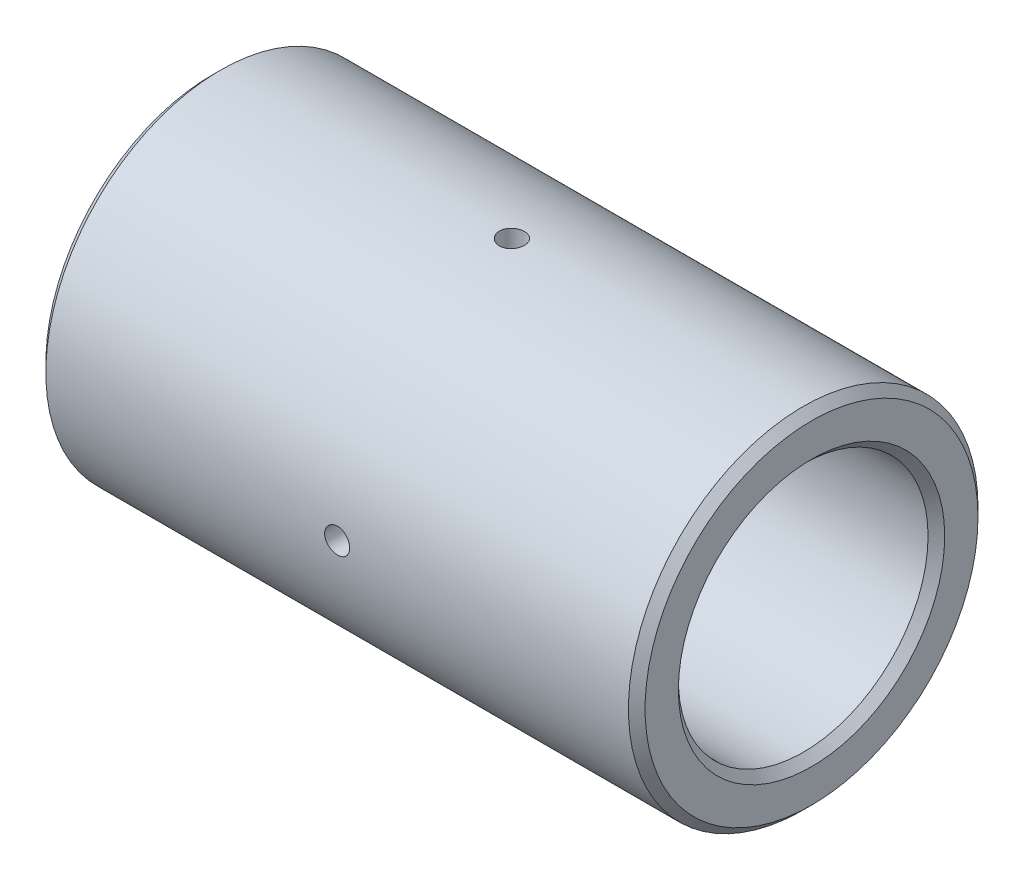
ISO-10303-21;
HEADER;
FILE_DESCRIPTION(('STEP AP214'),'2;1');
FILE_NAME('part.step','',(''),(''),'','','');
FILE_SCHEMA(('AUTOMOTIVE_DESIGN { 1 0 10303 214 1 1 1 1 }'));
ENDSEC;
DATA;
#1=APPLICATION_CONTEXT('core data for automotive mechanical design processes');
#2=APPLICATION_PROTOCOL_DEFINITION('international standard','automotive_design',2000,#1);
#3=PRODUCT_CONTEXT('',#1,'mechanical');
#4=PRODUCT('Part','Part','',(#3));
#5=PRODUCT_RELATED_PRODUCT_CATEGORY('part','',(#4));
#6=PRODUCT_DEFINITION_FORMATION('','',#4);
#7=PRODUCT_DEFINITION_CONTEXT('part definition',#1,'design');
#8=PRODUCT_DEFINITION('design','',#6,#7);
#9=PRODUCT_DEFINITION_SHAPE('','',#8);
#10=(LENGTH_UNIT() NAMED_UNIT(*) SI_UNIT(.MILLI.,.METRE.));
#11=(NAMED_UNIT(*) PLANE_ANGLE_UNIT() SI_UNIT($,.RADIAN.));
#12=(NAMED_UNIT(*) SI_UNIT($,.STERADIAN.) SOLID_ANGLE_UNIT());
#13=UNCERTAINTY_MEASURE_WITH_UNIT(LENGTH_MEASURE(1.E-05),#10,'distance_accuracy_value','');
#14=(GEOMETRIC_REPRESENTATION_CONTEXT(3) GLOBAL_UNCERTAINTY_ASSIGNED_CONTEXT((#13)) GLOBAL_UNIT_ASSIGNED_CONTEXT((#10,
#11,#12)) REPRESENTATION_CONTEXT('',''));
#15=CARTESIAN_POINT('',(0.,0.,0.));
#16=DIRECTION('',(0.,0.,1.));
#17=DIRECTION('',(1.,0.,0.));
#18=AXIS2_PLACEMENT_3D('',#15,#16,#17);
#19=CARTESIAN_POINT('',(94.5,0.,0.));
#20=DIRECTION('',(1.,0.,0.));
#21=DIRECTION('',(0.,0.,-1.));
#22=AXIS2_PLACEMENT_3D('',#19,#20,#21);
#23=CYLINDRICAL_SURFACE('',#22,17.);
#24=CARTESIAN_POINT('',(34.5,-1.77330760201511E-13,-17.));
#25=CARTESIAN_POINT('',(34.5000036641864,-0.0840802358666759,-16.9999991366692));
#26=CARTESIAN_POINT('',(34.5070932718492,-0.168217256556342,-16.9993695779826));
#27=CARTESIAN_POINT('',(34.5352700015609,-0.334162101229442,-16.9969186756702));
#28=CARTESIAN_POINT('',(34.5563728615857,-0.415967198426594,-16.9950959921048));
#29=CARTESIAN_POINT('',(34.6119599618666,-0.574820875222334,-16.9904647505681));
#30=CARTESIAN_POINT('',(34.6464364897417,-0.651872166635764,-16.987656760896));
#31=CARTESIAN_POINT('',(34.7277781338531,-0.79907619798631,-16.9813695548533));
#32=CARTESIAN_POINT('',(34.7746406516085,-0.86923038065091,-16.9778904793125));
#33=CARTESIAN_POINT('',(34.8795673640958,-1.00086587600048,-16.9706402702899));
#34=CARTESIAN_POINT('',(34.937659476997,-1.06232489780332,-16.9668684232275));
#35=CARTESIAN_POINT('',(35.0633371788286,-1.17463411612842,-16.9594637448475));
#36=CARTESIAN_POINT('',(35.1309231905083,-1.22548383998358,-16.9558309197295));
#37=CARTESIAN_POINT('',(35.273806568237,-1.31520757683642,-16.9491080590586));
#38=CARTESIAN_POINT('',(35.3491163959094,-1.35406181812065,-16.946018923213));
#39=CARTESIAN_POINT('',(35.5052229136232,-1.41856538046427,-16.9407415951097));
#40=CARTESIAN_POINT('',(35.5860194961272,-1.44421496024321,-16.9385533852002));
#41=CARTESIAN_POINT('',(35.7505813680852,-1.48151599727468,-16.9353318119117));
#42=CARTESIAN_POINT('',(35.8343383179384,-1.49320398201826,-16.9342954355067));
#43=CARTESIAN_POINT('',(36.0026310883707,-1.5023629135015,-16.9334854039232));
#44=CARTESIAN_POINT('',(36.0871668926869,-1.49983415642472,-16.9337117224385));
#45=CARTESIAN_POINT('',(36.2543669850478,-1.48066155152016,-16.9353987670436));
#46=CARTESIAN_POINT('',(36.3370358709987,-1.46405745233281,-16.9368560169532));
#47=CARTESIAN_POINT('',(36.4984088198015,-1.41726727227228,-16.9408352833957));
#48=CARTESIAN_POINT('',(36.577112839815,-1.38708104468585,-16.9433573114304));
#49=CARTESIAN_POINT('',(36.7284483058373,-1.31393915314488,-16.949185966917));
#50=CARTESIAN_POINT('',(36.8010711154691,-1.27096571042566,-16.9524936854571));
#51=CARTESIAN_POINT('',(36.9380882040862,-1.17348205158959,-16.9595200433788));
#52=CARTESIAN_POINT('',(37.0024822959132,-1.11897157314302,-16.9632386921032));
#53=CARTESIAN_POINT('',(37.1214451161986,-0.999738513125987,-16.9706833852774));
#54=CARTESIAN_POINT('',(37.1759794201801,-0.934981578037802,-16.9744094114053));
#55=CARTESIAN_POINT('',(37.2734082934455,-0.79721351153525,-16.9814369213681));
#56=CARTESIAN_POINT('',(37.3163028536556,-0.724202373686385,-16.984738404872));
#57=CARTESIAN_POINT('',(37.3892326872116,-0.571975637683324,-16.9905455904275));
#58=CARTESIAN_POINT('',(37.4192663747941,-0.492759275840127,-16.9930511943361));
#59=CARTESIAN_POINT('',(37.46559750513,-0.33038129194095,-16.996983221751));
#60=CARTESIAN_POINT('',(37.4818952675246,-0.247219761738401,-16.9984096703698));
#61=CARTESIAN_POINT('',(37.500248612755,-0.0796104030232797,-17.0000194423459));
#62=CARTESIAN_POINT('',(37.5023517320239,0.0048321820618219,-17.0002069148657));
#63=CARTESIAN_POINT('',(37.4923807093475,0.172868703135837,-16.9993287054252));
#64=CARTESIAN_POINT('',(37.4803067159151,0.256462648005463,-16.9982630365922));
#65=CARTESIAN_POINT('',(37.4423636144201,0.42029296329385,-16.9950010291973));
#66=CARTESIAN_POINT('',(37.4165166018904,0.50053449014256,-16.9928065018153));
#67=CARTESIAN_POINT('',(37.3517837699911,0.655542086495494,-16.9875332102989));
#68=CARTESIAN_POINT('',(37.312897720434,0.730308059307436,-16.9844544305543));
#69=CARTESIAN_POINT('',(37.2230716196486,0.872458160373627,-16.9777472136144));
#70=CARTESIAN_POINT('',(37.172100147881,0.939822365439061,-16.9741173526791));
#71=CARTESIAN_POINT('',(37.059595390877,1.06505544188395,-16.9667203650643));
#72=CARTESIAN_POINT('',(36.9980618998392,1.12292412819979,-16.9629532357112));
#73=CARTESIAN_POINT('',(36.8659732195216,1.22768709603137,-16.9556939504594));
#74=CARTESIAN_POINT('',(36.7953933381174,1.27455030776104,-16.9522025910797));
#75=CARTESIAN_POINT('',(36.64733797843,1.35575886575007,-16.9459016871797));
#76=CARTESIAN_POINT('',(36.5698625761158,1.39010434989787,-16.9430921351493));
#77=CARTESIAN_POINT('',(36.4103244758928,1.44524983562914,-16.9384775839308));
#78=CARTESIAN_POINT('',(36.3282683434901,1.46606870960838,-16.9366711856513));
#79=CARTESIAN_POINT('',(36.1618084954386,1.49363139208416,-16.9342628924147));
#80=CARTESIAN_POINT('',(36.0774048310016,1.50037550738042,-16.9336609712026));
#81=CARTESIAN_POINT('',(35.9089546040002,1.49959349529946,-16.9337302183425));
#82=CARTESIAN_POINT('',(35.8249078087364,1.49211618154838,-16.934397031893));
#83=CARTESIAN_POINT('',(35.659268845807,1.46320550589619,-16.936919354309));
#84=CARTESIAN_POINT('',(35.5776766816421,1.44177212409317,-16.9387748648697));
#85=CARTESIAN_POINT('',(35.4192609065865,1.38557040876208,-16.9434643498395));
#86=CARTESIAN_POINT('',(35.3424369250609,1.35080311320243,-16.9462982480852));
#87=CARTESIAN_POINT('',(35.1957079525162,1.26892580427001,-16.9526253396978));
#88=CARTESIAN_POINT('',(35.1258028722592,1.22181595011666,-16.9561185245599));
#89=CARTESIAN_POINT('',(34.9946460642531,1.11640728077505,-16.9633848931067));
#90=CARTESIAN_POINT('',(34.9334235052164,1.05807223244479,-16.9671589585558));
#91=CARTESIAN_POINT('',(34.8216124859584,0.931936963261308,-16.9745537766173));
#92=CARTESIAN_POINT('',(34.7710265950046,0.864134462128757,-16.97817449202));
#93=CARTESIAN_POINT('',(34.6818483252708,0.720843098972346,-16.9848619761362));
#94=CARTESIAN_POINT('',(34.6432806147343,0.645338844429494,-16.9879276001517));
#95=CARTESIAN_POINT('',(34.5794204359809,0.488949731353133,-16.9931463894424));
#96=CARTESIAN_POINT('',(34.5541127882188,0.408071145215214,-16.9953005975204));
#97=CARTESIAN_POINT('',(34.5238994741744,0.272267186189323,-16.9979040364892));
#98=CARTESIAN_POINT('',(34.514949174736,0.218213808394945,-16.9986864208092));
#99=CARTESIAN_POINT('',(34.5029982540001,0.10944830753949,-16.9997346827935));
#100=CARTESIAN_POINT('',(34.4999976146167,0.0547361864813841,-17.0000005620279));
#101=CARTESIAN_POINT('',(34.5,-1.77330760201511E-13,-17.));
#102=B_SPLINE_CURVE_WITH_KNOTS('',3,(#24,#25,#26,#27,#28,#29,#30,#31,#32,#33,#34,#35,#36,#37,
#38,#39,#40,#41,#42,#43,#44,#45,#46,#47,#48,#49,#50,#51,#52,#53,#54,#55,#56,#57,#58,#59,#60,#61,
#62,#63,#64,#65,#66,#67,#68,#69,#70,#71,#72,#73,#74,#75,#76,#77,#78,#79,#80,#81,#82,#83,#84,#85,
#86,#87,#88,#89,#90,#91,#92,#93,#94,#95,#96,#97,#98,#99,#100,#101),.UNSPECIFIED.,.T.,.F.,(4,2,2,
2,2,2,2,2,2,2,2,2,2,2,2,2,2,2,2,2,2,2,2,2,2,2,2,2,2,2,2,2,2,2,2,2,2,2,4),(0.,0.252040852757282,
0.504365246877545,0.756544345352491,1.00867058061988,1.26143188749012,1.51420445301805,
1.76739145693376,2.020573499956,2.27309168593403,2.52560461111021,2.77740680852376,
3.02921172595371,3.28136839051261,3.5335307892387,3.7865572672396,4.03958394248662,
4.29264180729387,4.54569378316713,4.79789789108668,5.05009935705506,5.30189743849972,
5.5536999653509,5.80616446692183,6.05863388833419,6.31180771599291,6.56497875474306,
6.81779580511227,7.07060734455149,7.32255269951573,7.57449841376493,7.82642451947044,
8.07834737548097,8.33109746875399,8.58390854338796,8.8372351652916,9.09027115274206,
9.25435010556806,9.41842855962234),.UNSPECIFIED.);
#103=CARTESIAN_POINT('',(34.5,-1.77330760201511E-13,-17.));
#104=VERTEX_POINT('',#103);
#105=CARTESIAN_POINT('',(37.5,-1.77330760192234E-13,-17.));
#106=VERTEX_POINT('',#105);
#107=EDGE_CURVE('E11',#104,#106,#102,.T.);
#108=ORIENTED_EDGE('',*,*,#107,.F.);
#109=CARTESIAN_POINT('',(34.5,0.,0.));
#110=DIRECTION('',(1.,0.,0.));
#111=DIRECTION('',(0.,0.,-1.));
#112=AXIS2_PLACEMENT_3D('',#109,#110,#111);
#113=CIRCLE('',#112,17.);
#114=CARTESIAN_POINT('',(34.5,-17.,0.));
#115=VERTEX_POINT('',#114);
#116=EDGE_CURVE('E119',#115,#104,#113,.T.);
#117=ORIENTED_EDGE('',*,*,#116,.F.);
#118=CARTESIAN_POINT('',(34.5,-17.,0.));
#119=CARTESIAN_POINT('',(34.5000036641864,-16.9999991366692,0.0840802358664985));
#120=CARTESIAN_POINT('',(34.5070932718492,-16.9993695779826,0.168217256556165));
#121=CARTESIAN_POINT('',(34.5352700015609,-16.9969186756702,0.334162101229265));
#122=CARTESIAN_POINT('',(34.5563728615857,-16.9950959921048,0.415967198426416));
#123=CARTESIAN_POINT('',(34.6119599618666,-16.9904647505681,0.574820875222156));
#124=CARTESIAN_POINT('',(34.6464364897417,-16.987656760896,0.651872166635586));
#125=CARTESIAN_POINT('',(34.7277781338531,-16.9813695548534,0.799076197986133));
#126=CARTESIAN_POINT('',(34.7746406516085,-16.9778904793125,0.869230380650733));
#127=CARTESIAN_POINT('',(34.8795673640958,-16.9706402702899,1.0008658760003));
#128=CARTESIAN_POINT('',(34.937659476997,-16.9668684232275,1.06232489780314));
#129=CARTESIAN_POINT('',(35.0633371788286,-16.9594637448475,1.17463411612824));
#130=CARTESIAN_POINT('',(35.1309231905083,-16.9558309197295,1.22548383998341));
#131=CARTESIAN_POINT('',(35.273806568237,-16.9491080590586,1.31520757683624));
#132=CARTESIAN_POINT('',(35.3491163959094,-16.9460189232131,1.35406181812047));
#133=CARTESIAN_POINT('',(35.5052229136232,-16.9407415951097,1.41856538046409));
#134=CARTESIAN_POINT('',(35.5860194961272,-16.9385533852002,1.44421496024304));
#135=CARTESIAN_POINT('',(35.7505813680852,-16.9353318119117,1.4815159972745));
#136=CARTESIAN_POINT('',(35.8343383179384,-16.9342954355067,1.49320398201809));
#137=CARTESIAN_POINT('',(36.0026310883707,-16.9334854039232,1.50236291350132));
#138=CARTESIAN_POINT('',(36.0871668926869,-16.9337117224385,1.49983415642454));
#139=CARTESIAN_POINT('',(36.2543669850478,-16.9353987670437,1.48066155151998));
#140=CARTESIAN_POINT('',(36.3370358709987,-16.9368560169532,1.46405745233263));
#141=CARTESIAN_POINT('',(36.4984088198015,-16.9408352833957,1.41726727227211));
#142=CARTESIAN_POINT('',(36.577112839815,-16.9433573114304,1.38708104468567));
#143=CARTESIAN_POINT('',(36.7284483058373,-16.949185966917,1.3139391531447));
#144=CARTESIAN_POINT('',(36.8010711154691,-16.9524936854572,1.27096571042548));
#145=CARTESIAN_POINT('',(36.9380882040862,-16.9595200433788,1.17348205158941));
#146=CARTESIAN_POINT('',(37.0024822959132,-16.9632386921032,1.11897157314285));
#147=CARTESIAN_POINT('',(37.1214451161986,-16.9706833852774,0.99973851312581));
#148=CARTESIAN_POINT('',(37.1759794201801,-16.9744094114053,0.934981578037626));
#149=CARTESIAN_POINT('',(37.2734082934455,-16.9814369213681,0.797213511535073));
#150=CARTESIAN_POINT('',(37.3163028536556,-16.984738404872,0.724202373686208));
#151=CARTESIAN_POINT('',(37.3892326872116,-16.9905455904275,0.571975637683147));
#152=CARTESIAN_POINT('',(37.4192663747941,-16.9930511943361,0.492759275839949));
#153=CARTESIAN_POINT('',(37.46559750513,-16.996983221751,0.330381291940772));
#154=CARTESIAN_POINT('',(37.4818952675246,-16.9984096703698,0.247219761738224));
#155=CARTESIAN_POINT('',(37.500248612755,-17.0000194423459,0.0796104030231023));
#156=CARTESIAN_POINT('',(37.5023517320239,-17.0002069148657,-0.00483218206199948));
#157=CARTESIAN_POINT('',(37.4923807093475,-16.9993287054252,-0.172868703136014));
#158=CARTESIAN_POINT('',(37.4803067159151,-16.9982630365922,-0.25646264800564));
#159=CARTESIAN_POINT('',(37.4423636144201,-16.9950010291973,-0.420292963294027));
#160=CARTESIAN_POINT('',(37.4165166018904,-16.9928065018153,-0.500534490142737));
#161=CARTESIAN_POINT('',(37.3517837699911,-16.9875332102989,-0.655542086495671));
#162=CARTESIAN_POINT('',(37.312897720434,-16.9844544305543,-0.730308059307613));
#163=CARTESIAN_POINT('',(37.2230716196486,-16.9777472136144,-0.872458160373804));
#164=CARTESIAN_POINT('',(37.172100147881,-16.9741173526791,-0.939822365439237));
#165=CARTESIAN_POINT('',(37.059595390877,-16.9667203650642,-1.06505544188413));
#166=CARTESIAN_POINT('',(36.9980618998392,-16.9629532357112,-1.12292412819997));
#167=CARTESIAN_POINT('',(36.8659732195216,-16.9556939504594,-1.22768709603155));
#168=CARTESIAN_POINT('',(36.7953933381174,-16.9522025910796,-1.27455030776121));
#169=CARTESIAN_POINT('',(36.64733797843,-16.9459016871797,-1.35575886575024));
#170=CARTESIAN_POINT('',(36.5698625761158,-16.9430921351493,-1.39010434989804));
#171=CARTESIAN_POINT('',(36.4103244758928,-16.9384775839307,-1.44524983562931));
#172=CARTESIAN_POINT('',(36.3282683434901,-16.9366711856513,-1.46606870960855));
#173=CARTESIAN_POINT('',(36.1618084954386,-16.9342628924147,-1.49363139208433));
#174=CARTESIAN_POINT('',(36.0774048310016,-16.9336609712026,-1.50037550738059));
#175=CARTESIAN_POINT('',(35.9089546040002,-16.9337302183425,-1.49959349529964));
#176=CARTESIAN_POINT('',(35.8249078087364,-16.934397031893,-1.49211618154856));
#177=CARTESIAN_POINT('',(35.659268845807,-16.936919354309,-1.46320550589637));
#178=CARTESIAN_POINT('',(35.5776766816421,-16.9387748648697,-1.44177212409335));
#179=CARTESIAN_POINT('',(35.4192609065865,-16.9434643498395,-1.38557040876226));
#180=CARTESIAN_POINT('',(35.3424369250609,-16.9462982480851,-1.35080311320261));
#181=CARTESIAN_POINT('',(35.1957079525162,-16.9526253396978,-1.26892580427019));
#182=CARTESIAN_POINT('',(35.1258028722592,-16.9561185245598,-1.22181595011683));
#183=CARTESIAN_POINT('',(34.9946460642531,-16.9633848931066,-1.11640728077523));
#184=CARTESIAN_POINT('',(34.9334235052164,-16.9671589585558,-1.05807223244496));
#185=CARTESIAN_POINT('',(34.8216124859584,-16.9745537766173,-0.931936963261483));
#186=CARTESIAN_POINT('',(34.7710265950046,-16.97817449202,-0.864134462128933));
#187=CARTESIAN_POINT('',(34.6818483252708,-16.9848619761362,-0.720843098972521));
#188=CARTESIAN_POINT('',(34.6432806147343,-16.9879276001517,-0.645338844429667));
#189=CARTESIAN_POINT('',(34.5794204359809,-16.9931463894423,-0.488949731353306));
#190=CARTESIAN_POINT('',(34.5541127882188,-16.9953005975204,-0.408071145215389));
#191=CARTESIAN_POINT('',(34.5238994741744,-16.9979040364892,-0.272267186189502));
#192=CARTESIAN_POINT('',(34.514949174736,-16.9986864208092,-0.218213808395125));
#193=CARTESIAN_POINT('',(34.5029982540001,-16.9997346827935,-0.109448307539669));
#194=CARTESIAN_POINT('',(34.4999976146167,-17.0000005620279,-0.0547361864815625));
#195=CARTESIAN_POINT('',(34.5,-17.,0.));
#196=B_SPLINE_CURVE_WITH_KNOTS('',3,(#118,#119,#120,#121,#122,#123,#124,#125,#126,#127,#128,
#129,#130,#131,#132,#133,#134,#135,#136,#137,#138,#139,#140,#141,#142,#143,#144,#145,#146,#147,
#148,#149,#150,#151,#152,#153,#154,#155,#156,#157,#158,#159,#160,#161,#162,#163,#164,#165,#166,
#167,#168,#169,#170,#171,#172,#173,#174,#175,#176,#177,#178,#179,#180,#181,#182,#183,#184,#185,
#186,#187,#188,#189,#190,#191,#192,#193,#194,#195),.UNSPECIFIED.,.T.,.F.,(4,2,2,2,2,2,2,2,2,2,2,
2,2,2,2,2,2,2,2,2,2,2,2,2,2,2,2,2,2,2,2,2,2,2,2,2,2,2,4),(0.,0.252040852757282,
0.504365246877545,0.756544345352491,1.00867058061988,1.26143188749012,1.51420445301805,
1.76739145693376,2.020573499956,2.27309168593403,2.52560461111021,2.77740680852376,
3.02921172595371,3.28136839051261,3.5335307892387,3.7865572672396,4.03958394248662,
4.29264180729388,4.54569378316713,4.79789789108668,5.05009935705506,5.30189743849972,
5.5536999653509,5.80616446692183,6.05863388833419,6.31180771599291,6.56497875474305,
6.81779580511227,7.07060734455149,7.32255269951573,7.57449841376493,7.82642451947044,
8.07834737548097,8.331097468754,8.58390854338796,8.8372351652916,9.09027115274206,
9.25435010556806,9.41842855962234),.UNSPECIFIED.);
#197=CARTESIAN_POINT('',(37.5,-17.,0.));
#198=VERTEX_POINT('',#197);
#199=EDGE_CURVE('E109',#198,#115,#196,.T.);
#200=ORIENTED_EDGE('',*,*,#199,.F.);
#201=CARTESIAN_POINT('',(37.5,0.,0.));
#202=DIRECTION('',(1.,0.,0.));
#203=DIRECTION('',(0.,0.,-1.));
#204=AXIS2_PLACEMENT_3D('',#201,#202,#203);
#205=CIRCLE('',#204,17.);
#206=EDGE_CURVE('E103',#198,#106,#205,.T.);
#207=ORIENTED_EDGE('',*,*,#206,.T.);
#208=EDGE_LOOP('',(#108,#117,#200,#207));
#209=FACE_BOUND('',#208,.T.);
#210=ADVANCED_FACE('F43',(#209),#23,.F.);
#211=EDGE_CURVE('E47',#106,#104,#102,.T.);
#212=ORIENTED_EDGE('',*,*,#211,.F.);
#213=CARTESIAN_POINT('',(37.5,17.,0.));
#214=VERTEX_POINT('',#213);
#215=EDGE_CURVE('E93',#106,#214,#205,.T.);
#216=ORIENTED_EDGE('',*,*,#215,.T.);
#217=CARTESIAN_POINT('',(34.5,17.,0.));
#218=CARTESIAN_POINT('',(34.5000036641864,16.9999991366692,-0.0840802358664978));
#219=CARTESIAN_POINT('',(34.5070932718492,16.9993695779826,-0.168217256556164));
#220=CARTESIAN_POINT('',(34.5352700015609,16.9969186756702,-0.334162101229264));
#221=CARTESIAN_POINT('',(34.5563728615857,16.9950959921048,-0.415967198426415));
#222=CARTESIAN_POINT('',(34.6119599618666,16.9904647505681,-0.574820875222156));
#223=CARTESIAN_POINT('',(34.6464364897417,16.987656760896,-0.651872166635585));
#224=CARTESIAN_POINT('',(34.7277781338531,16.9813695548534,-0.799076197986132));
#225=CARTESIAN_POINT('',(34.7746406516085,16.9778904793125,-0.869230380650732));
#226=CARTESIAN_POINT('',(34.8795673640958,16.9706402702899,-1.0008658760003));
#227=CARTESIAN_POINT('',(34.937659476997,16.9668684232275,-1.06232489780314));
#228=CARTESIAN_POINT('',(35.0633371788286,16.9594637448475,-1.17463411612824));
#229=CARTESIAN_POINT('',(35.1309231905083,16.9558309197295,-1.22548383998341));
#230=CARTESIAN_POINT('',(35.273806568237,16.9491080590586,-1.31520757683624));
#231=CARTESIAN_POINT('',(35.3491163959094,16.9460189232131,-1.35406181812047));
#232=CARTESIAN_POINT('',(35.5052229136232,16.9407415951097,-1.41856538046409));
#233=CARTESIAN_POINT('',(35.5860194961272,16.9385533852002,-1.44421496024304));
#234=CARTESIAN_POINT('',(35.7505813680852,16.9353318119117,-1.4815159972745));
#235=CARTESIAN_POINT('',(35.8343383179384,16.9342954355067,-1.49320398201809));
#236=CARTESIAN_POINT('',(36.0026310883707,16.9334854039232,-1.50236291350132));
#237=CARTESIAN_POINT('',(36.0871668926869,16.9337117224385,-1.49983415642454));
#238=CARTESIAN_POINT('',(36.2543669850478,16.9353987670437,-1.48066155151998));
#239=CARTESIAN_POINT('',(36.3370358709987,16.9368560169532,-1.46405745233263));
#240=CARTESIAN_POINT('',(36.4984088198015,16.9408352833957,-1.41726727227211));
#241=CARTESIAN_POINT('',(36.577112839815,16.9433573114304,-1.38708104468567));
#242=CARTESIAN_POINT('',(36.7284483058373,16.949185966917,-1.3139391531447));
#243=CARTESIAN_POINT('',(36.8010711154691,16.9524936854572,-1.27096571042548));
#244=CARTESIAN_POINT('',(36.9380882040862,16.9595200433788,-1.17348205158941));
#245=CARTESIAN_POINT('',(37.0024822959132,16.9632386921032,-1.11897157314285));
#246=CARTESIAN_POINT('',(37.1214451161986,16.9706833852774,-0.999738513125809));
#247=CARTESIAN_POINT('',(37.1759794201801,16.9744094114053,-0.934981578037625));
#248=CARTESIAN_POINT('',(37.2734082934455,16.9814369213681,-0.797213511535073));
#249=CARTESIAN_POINT('',(37.3163028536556,16.984738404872,-0.724202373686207));
#250=CARTESIAN_POINT('',(37.3892326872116,16.9905455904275,-0.571975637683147));
#251=CARTESIAN_POINT('',(37.4192663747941,16.9930511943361,-0.492759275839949));
#252=CARTESIAN_POINT('',(37.46559750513,16.996983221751,-0.330381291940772));
#253=CARTESIAN_POINT('',(37.4818952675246,16.9984096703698,-0.247219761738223));
#254=CARTESIAN_POINT('',(37.500248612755,17.0000194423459,-0.0796104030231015));
#255=CARTESIAN_POINT('',(37.5023517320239,17.0002069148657,0.00483218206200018));
#256=CARTESIAN_POINT('',(37.4923807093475,16.9993287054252,0.172868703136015));
#257=CARTESIAN_POINT('',(37.4803067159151,16.9982630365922,0.256462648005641));
#258=CARTESIAN_POINT('',(37.4423636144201,16.9950010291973,0.420292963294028));
#259=CARTESIAN_POINT('',(37.4165166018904,16.9928065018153,0.500534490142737));
#260=CARTESIAN_POINT('',(37.3517837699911,16.9875332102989,0.655542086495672));
#261=CARTESIAN_POINT('',(37.3128977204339,16.9844544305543,0.730308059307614));
#262=CARTESIAN_POINT('',(37.2230716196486,16.9777472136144,0.872458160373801));
#263=CARTESIAN_POINT('',(37.172100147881,16.9741173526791,0.939822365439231));
#264=CARTESIAN_POINT('',(37.059595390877,16.9667203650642,1.06505544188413));
#265=CARTESIAN_POINT('',(36.9980618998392,16.9629532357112,1.12292412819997));
#266=CARTESIAN_POINT('',(36.8659732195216,16.9556939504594,1.22768709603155));
#267=CARTESIAN_POINT('',(36.7953933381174,16.9522025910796,1.27455030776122));
#268=CARTESIAN_POINT('',(36.64733797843,16.9459016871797,1.35575886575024));
#269=CARTESIAN_POINT('',(36.5698625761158,16.9430921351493,1.39010434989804));
#270=CARTESIAN_POINT('',(36.4103244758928,16.9384775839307,1.44524983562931));
#271=CARTESIAN_POINT('',(36.3282683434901,16.9366711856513,1.46606870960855));
#272=CARTESIAN_POINT('',(36.1618084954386,16.9342628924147,1.49363139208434));
#273=CARTESIAN_POINT('',(36.0774048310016,16.9336609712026,1.50037550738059));
#274=CARTESIAN_POINT('',(35.9089546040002,16.9337302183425,1.49959349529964));
#275=CARTESIAN_POINT('',(35.8249078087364,16.934397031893,1.49211618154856));
#276=CARTESIAN_POINT('',(35.659268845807,16.936919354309,1.46320550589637));
#277=CARTESIAN_POINT('',(35.5776766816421,16.9387748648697,1.44177212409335));
#278=CARTESIAN_POINT('',(35.4192609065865,16.9434643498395,1.38557040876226));
#279=CARTESIAN_POINT('',(35.3424369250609,16.9462982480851,1.35080311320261));
#280=CARTESIAN_POINT('',(35.1957079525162,16.9526253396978,1.26892580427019));
#281=CARTESIAN_POINT('',(35.1258028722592,16.9561185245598,1.22181595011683));
#282=CARTESIAN_POINT('',(34.9946460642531,16.9633848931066,1.11640728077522));
#283=CARTESIAN_POINT('',(34.9334235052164,16.9671589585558,1.05807223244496));
#284=CARTESIAN_POINT('',(34.8216124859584,16.9745537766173,0.931936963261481));
#285=CARTESIAN_POINT('',(34.7710265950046,16.97817449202,0.864134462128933));
#286=CARTESIAN_POINT('',(34.6818483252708,16.9848619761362,0.720843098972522));
#287=CARTESIAN_POINT('',(34.6432806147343,16.9879276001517,0.645338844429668));
#288=CARTESIAN_POINT('',(34.5794204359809,16.9931463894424,0.488949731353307));
#289=CARTESIAN_POINT('',(34.5541127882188,16.9953005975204,0.40807114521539));
#290=CARTESIAN_POINT('',(34.5238994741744,16.9979040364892,0.272267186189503));
#291=CARTESIAN_POINT('',(34.514949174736,16.9986864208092,0.218213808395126));
#292=CARTESIAN_POINT('',(34.5029982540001,16.9997346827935,0.10944830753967));
#293=CARTESIAN_POINT('',(34.4999976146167,17.0000005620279,0.0547361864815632));
#294=CARTESIAN_POINT('',(34.5,17.,0.));
#295=B_SPLINE_CURVE_WITH_KNOTS('',3,(#217,#218,#219,#220,#221,#222,#223,#224,#225,#226,#227,
#228,#229,#230,#231,#232,#233,#234,#235,#236,#237,#238,#239,#240,#241,#242,#243,#244,#245,#246,
#247,#248,#249,#250,#251,#252,#253,#254,#255,#256,#257,#258,#259,#260,#261,#262,#263,#264,#265,
#266,#267,#268,#269,#270,#271,#272,#273,#274,#275,#276,#277,#278,#279,#280,#281,#282,#283,#284,
#285,#286,#287,#288,#289,#290,#291,#292,#293,#294),.UNSPECIFIED.,.T.,.F.,(4,2,2,2,2,2,2,2,2,2,2,
2,2,2,2,2,2,2,2,2,2,2,2,2,2,2,2,2,2,2,2,2,2,2,2,2,2,2,4),(0.,0.252040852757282,
0.504365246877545,0.756544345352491,1.00867058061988,1.26143188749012,1.51420445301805,
1.76739145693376,2.020573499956,2.27309168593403,2.52560461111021,2.77740680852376,
3.02921172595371,3.28136839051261,3.5335307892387,3.7865572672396,4.03958394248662,
4.29264180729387,4.54569378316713,4.79789789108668,5.05009935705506,5.30189743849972,
5.5536999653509,5.80616446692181,6.05863388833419,6.31180771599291,6.56497875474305,
6.81779580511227,7.0706073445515,7.32255269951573,7.57449841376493,7.82642451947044,
8.07834737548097,8.33109746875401,8.58390854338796,8.8372351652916,9.09027115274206,
9.25435010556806,9.41842855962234),.UNSPECIFIED.);
#296=CARTESIAN_POINT('',(34.5,17.,0.));
#297=VERTEX_POINT('',#296);
#298=EDGE_CURVE('E96',#297,#214,#295,.T.);
#299=ORIENTED_EDGE('',*,*,#298,.F.);
#300=EDGE_CURVE('E68',#104,#297,#113,.T.);
#301=ORIENTED_EDGE('',*,*,#300,.F.);
#302=EDGE_LOOP('',(#212,#216,#299,#301));
#303=FACE_BOUND('',#302,.T.);
#304=ADVANCED_FACE('F91',(#303),#23,.F.);
#305=EDGE_CURVE('E233',#214,#297,#295,.T.);
#306=ORIENTED_EDGE('',*,*,#305,.F.);
#307=CARTESIAN_POINT('',(37.5,0.,17.));
#308=VERTEX_POINT('',#307);
#309=EDGE_CURVE('E104',#214,#308,#205,.T.);
#310=ORIENTED_EDGE('',*,*,#309,.T.);
#311=CARTESIAN_POINT('',(34.5,0.,17.));
#312=CARTESIAN_POINT('',(34.5000036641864,0.0840802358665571,16.9999991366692));
#313=CARTESIAN_POINT('',(34.5070932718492,0.168217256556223,16.9993695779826));
#314=CARTESIAN_POINT('',(34.5352700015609,0.334162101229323,16.9969186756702));
#315=CARTESIAN_POINT('',(34.5563728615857,0.415967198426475,16.9950959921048));
#316=CARTESIAN_POINT('',(34.6119599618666,0.574820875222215,16.9904647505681));
#317=CARTESIAN_POINT('',(34.6464364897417,0.651872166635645,16.987656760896));
#318=CARTESIAN_POINT('',(34.7277781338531,0.799076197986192,16.9813695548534));
#319=CARTESIAN_POINT('',(34.7746406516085,0.869230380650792,16.9778904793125));
#320=CARTESIAN_POINT('',(34.8795673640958,1.00086587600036,16.9706402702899));
#321=CARTESIAN_POINT('',(34.937659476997,1.0623248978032,16.9668684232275));
#322=CARTESIAN_POINT('',(35.0633371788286,1.1746341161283,16.9594637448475));
#323=CARTESIAN_POINT('',(35.1309231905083,1.22548383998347,16.9558309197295));
#324=CARTESIAN_POINT('',(35.273806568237,1.3152075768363,16.9491080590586));
#325=CARTESIAN_POINT('',(35.3491163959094,1.35406181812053,16.946018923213));
#326=CARTESIAN_POINT('',(35.5052229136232,1.41856538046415,16.9407415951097));
#327=CARTESIAN_POINT('',(35.5860194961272,1.44421496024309,16.9385533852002));
#328=CARTESIAN_POINT('',(35.7505813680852,1.48151599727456,16.9353318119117));
#329=CARTESIAN_POINT('',(35.8343383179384,1.49320398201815,16.9342954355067));
#330=CARTESIAN_POINT('',(36.0026310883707,1.50236291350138,16.9334854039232));
#331=CARTESIAN_POINT('',(36.0871668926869,1.4998341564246,16.9337117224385));
#332=CARTESIAN_POINT('',(36.2543669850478,1.48066155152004,16.9353987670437));
#333=CARTESIAN_POINT('',(36.3370358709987,1.46405745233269,16.9368560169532));
#334=CARTESIAN_POINT('',(36.4984088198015,1.41726727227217,16.9408352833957));
#335=CARTESIAN_POINT('',(36.577112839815,1.38708104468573,16.9433573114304));
#336=CARTESIAN_POINT('',(36.7284483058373,1.31393915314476,16.949185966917));
#337=CARTESIAN_POINT('',(36.8010711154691,1.27096571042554,16.9524936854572));
#338=CARTESIAN_POINT('',(36.9380882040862,1.17348205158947,16.9595200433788));
#339=CARTESIAN_POINT('',(37.0024822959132,1.11897157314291,16.9632386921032));
#340=CARTESIAN_POINT('',(37.1214451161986,0.999738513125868,16.9706833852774));
#341=CARTESIAN_POINT('',(37.1759794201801,0.934981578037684,16.9744094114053));
#342=CARTESIAN_POINT('',(37.2734082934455,0.797213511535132,16.9814369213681));
#343=CARTESIAN_POINT('',(37.3163028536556,0.724202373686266,16.984738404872));
#344=CARTESIAN_POINT('',(37.3892326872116,0.571975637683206,16.9905455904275));
#345=CARTESIAN_POINT('',(37.4192663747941,0.492759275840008,16.9930511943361));
#346=CARTESIAN_POINT('',(37.46559750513,0.330381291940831,16.996983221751));
#347=CARTESIAN_POINT('',(37.4818952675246,0.247219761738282,16.9984096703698));
#348=CARTESIAN_POINT('',(37.500248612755,0.0796104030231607,17.0000194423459));
#349=CARTESIAN_POINT('',(37.5023517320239,-0.00483218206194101,17.0002069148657));
#350=CARTESIAN_POINT('',(37.4923807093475,-0.172868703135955,16.9993287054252));
#351=CARTESIAN_POINT('',(37.4803067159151,-0.256462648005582,16.9982630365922));
#352=CARTESIAN_POINT('',(37.4423636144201,-0.420292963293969,16.9950010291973));
#353=CARTESIAN_POINT('',(37.4165166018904,-0.500534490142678,16.9928065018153));
#354=CARTESIAN_POINT('',(37.3517837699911,-0.655542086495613,16.9875332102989));
#355=CARTESIAN_POINT('',(37.3128977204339,-0.730308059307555,16.9844544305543));
#356=CARTESIAN_POINT('',(37.2230716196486,-0.872458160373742,16.9777472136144));
#357=CARTESIAN_POINT('',(37.172100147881,-0.939822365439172,16.9741173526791));
#358=CARTESIAN_POINT('',(37.059595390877,-1.06505544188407,16.9667203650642));
#359=CARTESIAN_POINT('',(36.9980618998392,-1.12292412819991,16.9629532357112));
#360=CARTESIAN_POINT('',(36.8659732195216,-1.22768709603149,16.9556939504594));
#361=CARTESIAN_POINT('',(36.7953933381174,-1.27455030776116,16.9522025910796));
#362=CARTESIAN_POINT('',(36.64733797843,-1.35575886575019,16.9459016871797));
#363=CARTESIAN_POINT('',(36.5698625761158,-1.39010434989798,16.9430921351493));
#364=CARTESIAN_POINT('',(36.4103244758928,-1.44524983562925,16.9384775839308));
#365=CARTESIAN_POINT('',(36.3282683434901,-1.46606870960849,16.9366711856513));
#366=CARTESIAN_POINT('',(36.1618084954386,-1.49363139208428,16.9342628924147));
#367=CARTESIAN_POINT('',(36.0774048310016,-1.50037550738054,16.9336609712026));
#368=CARTESIAN_POINT('',(35.9089546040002,-1.49959349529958,16.9337302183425));
#369=CARTESIAN_POINT('',(35.8249078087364,-1.4921161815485,16.934397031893));
#370=CARTESIAN_POINT('',(35.659268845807,-1.46320550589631,16.936919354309));
#371=CARTESIAN_POINT('',(35.5776766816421,-1.44177212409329,16.9387748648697));
#372=CARTESIAN_POINT('',(35.4192609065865,-1.3855704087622,16.9434643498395));
#373=CARTESIAN_POINT('',(35.3424369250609,-1.35080311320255,16.9462982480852));
#374=CARTESIAN_POINT('',(35.1957079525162,-1.26892580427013,16.9526253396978));
#375=CARTESIAN_POINT('',(35.1258028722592,-1.22181595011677,16.9561185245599));
#376=CARTESIAN_POINT('',(34.9946460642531,-1.11640728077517,16.9633848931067));
#377=CARTESIAN_POINT('',(34.9334235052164,-1.0580722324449,16.9671589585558));
#378=CARTESIAN_POINT('',(34.8216124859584,-0.931936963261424,16.9745537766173));
#379=CARTESIAN_POINT('',(34.7710265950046,-0.864134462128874,16.97817449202));
#380=CARTESIAN_POINT('',(34.6818483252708,-0.720843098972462,16.9848619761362));
#381=CARTESIAN_POINT('',(34.6432806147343,-0.645338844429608,16.9879276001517));
#382=CARTESIAN_POINT('',(34.5794204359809,-0.488949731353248,16.9931463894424));
#383=CARTESIAN_POINT('',(34.5541127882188,-0.40807114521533,16.9953005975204));
#384=CARTESIAN_POINT('',(34.5238994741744,-0.272267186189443,16.9979040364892));
#385=CARTESIAN_POINT('',(34.514949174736,-0.218213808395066,16.9986864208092));
#386=CARTESIAN_POINT('',(34.5029982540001,-0.109448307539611,16.9997346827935));
#387=CARTESIAN_POINT('',(34.4999976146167,-0.0547361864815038,17.0000005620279));
#388=CARTESIAN_POINT('',(34.5,0.,17.));
#389=B_SPLINE_CURVE_WITH_KNOTS('',3,(#311,#312,#313,#314,#315,#316,#317,#318,#319,#320,#321,
#322,#323,#324,#325,#326,#327,#328,#329,#330,#331,#332,#333,#334,#335,#336,#337,#338,#339,#340,
#341,#342,#343,#344,#345,#346,#347,#348,#349,#350,#351,#352,#353,#354,#355,#356,#357,#358,#359,
#360,#361,#362,#363,#364,#365,#366,#367,#368,#369,#370,#371,#372,#373,#374,#375,#376,#377,#378,
#379,#380,#381,#382,#383,#384,#385,#386,#387,#388),.UNSPECIFIED.,.T.,.F.,(4,2,2,2,2,2,2,2,2,2,2,
2,2,2,2,2,2,2,2,2,2,2,2,2,2,2,2,2,2,2,2,2,2,2,2,2,2,2,4),(0.,0.252040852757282,
0.504365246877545,0.756544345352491,1.00867058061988,1.26143188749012,1.51420445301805,
1.76739145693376,2.020573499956,2.27309168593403,2.52560461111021,2.77740680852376,
3.02921172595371,3.28136839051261,3.5335307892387,3.7865572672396,4.03958394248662,
4.29264180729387,4.54569378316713,4.79789789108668,5.05009935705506,5.30189743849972,
5.5536999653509,5.80616446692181,6.05863388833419,6.31180771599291,6.56497875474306,
6.81779580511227,7.07060734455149,7.32255269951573,7.57449841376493,7.82642451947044,
8.07834737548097,8.331097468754,8.58390854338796,8.8372351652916,9.09027115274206,
9.25435010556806,9.41842855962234),.UNSPECIFIED.);
#390=CARTESIAN_POINT('',(34.5,0.,17.));
#391=VERTEX_POINT('',#390);
#392=EDGE_CURVE('E238',#391,#308,#389,.T.);
#393=ORIENTED_EDGE('',*,*,#392,.F.);
#394=EDGE_CURVE('E128',#297,#391,#113,.T.);
#395=ORIENTED_EDGE('',*,*,#394,.F.);
#396=EDGE_LOOP('',(#306,#310,#393,#395));
#397=FACE_BOUND('',#396,.T.);
#398=ADVANCED_FACE('F211',(#397),#23,.F.);
#399=CARTESIAN_POINT('',(71.,0.,0.));
#400=DIRECTION('',(1.,0.,0.));
#401=DIRECTION('',(0.,0.,-1.));
#402=AXIS2_PLACEMENT_3D('',#399,#400,#401);
#403=CONICAL_SURFACE('',#402,15.,0.785398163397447);
#404=CARTESIAN_POINT('',(72.,0.,0.));
#405=DIRECTION('',(1.,0.,0.));
#406=DIRECTION('',(0.,0.,-1.));
#407=AXIS2_PLACEMENT_3D('',#404,#405,#406);
#408=CIRCLE('',#407,16.);
#409=CARTESIAN_POINT('',(72.,0.,-16.));
#410=VERTEX_POINT('',#409);
#411=EDGE_CURVE('E163',#410,#410,#408,.T.);
#412=ORIENTED_EDGE('',*,*,#411,.T.);
#413=EDGE_LOOP('',(#412));
#414=FACE_BOUND('',#413,.T.);
#415=CARTESIAN_POINT('',(71.,0.,0.));
#416=DIRECTION('',(1.,0.,0.));
#417=DIRECTION('',(0.,0.,-1.));
#418=AXIS2_PLACEMENT_3D('',#415,#416,#417);
#419=CIRCLE('',#418,15.);
#420=CARTESIAN_POINT('',(71.,0.,-15.));
#421=VERTEX_POINT('',#420);
#422=EDGE_CURVE('E115',#421,#421,#419,.T.);
#423=ORIENTED_EDGE('',*,*,#422,.F.);
#424=EDGE_LOOP('',(#423));
#425=FACE_BOUND('',#424,.T.);
#426=ADVANCED_FACE('F224',(#414,#425),#403,.F.);
#427=CARTESIAN_POINT('',(94.5,0.,0.));
#428=DIRECTION('',(1.,0.,0.));
#429=DIRECTION('',(0.,0.,-1.));
#430=AXIS2_PLACEMENT_3D('',#427,#428,#429);
#431=CYLINDRICAL_SURFACE('',#430,15.);
#432=ORIENTED_EDGE('',*,*,#422,.T.);
#433=EDGE_LOOP('',(#432));
#434=FACE_BOUND('',#433,.T.);
#435=CARTESIAN_POINT('',(37.5,0.,0.));
#436=DIRECTION('',(1.,0.,0.));
#437=DIRECTION('',(0.,0.,-1.));
#438=AXIS2_PLACEMENT_3D('',#435,#436,#437);
#439=CIRCLE('',#438,15.);
#440=CARTESIAN_POINT('',(37.5,0.,-15.));
#441=VERTEX_POINT('',#440);
#442=EDGE_CURVE('E111',#441,#441,#439,.T.);
#443=ORIENTED_EDGE('',*,*,#442,.F.);
#444=EDGE_LOOP('',(#443));
#445=FACE_BOUND('',#444,.T.);
#446=ADVANCED_FACE('F222',(#434,#445),#431,.F.);
#447=CARTESIAN_POINT('',(37.5,15.,0.));
#448=DIRECTION('',(-1.,0.,0.));
#449=DIRECTION('',(0.,0.,1.));
#450=AXIS2_PLACEMENT_3D('',#447,#448,#449);
#451=PLANE('',#450);
#452=ORIENTED_EDGE('',*,*,#215,.F.);
#453=ORIENTED_EDGE('',*,*,#206,.F.);
#454=EDGE_CURVE('E112',#308,#198,#205,.T.);
#455=ORIENTED_EDGE('',*,*,#454,.F.);
#456=ORIENTED_EDGE('',*,*,#309,.F.);
#457=EDGE_LOOP('',(#452,#453,#455,#456));
#458=FACE_BOUND('',#457,.T.);
#459=ORIENTED_EDGE('',*,*,#442,.T.);
#460=EDGE_LOOP('',(#459));
#461=FACE_BOUND('',#460,.T.);
#462=ADVANCED_FACE('F100',(#458,#461),#451,.T.);
#463=EDGE_CURVE('E241',#308,#391,#389,.T.);
#464=ORIENTED_EDGE('',*,*,#463,.F.);
#465=ORIENTED_EDGE('',*,*,#454,.T.);
#466=EDGE_CURVE('E261',#115,#198,#196,.T.);
#467=ORIENTED_EDGE('',*,*,#466,.F.);
#468=EDGE_CURVE('E126',#391,#115,#113,.T.);
#469=ORIENTED_EDGE('',*,*,#468,.F.);
#470=EDGE_LOOP('',(#464,#465,#467,#469));
#471=FACE_BOUND('',#470,.T.);
#472=ADVANCED_FACE('F207',(#471),#23,.F.);
#473=CARTESIAN_POINT('',(34.5,17.,0.));
#474=DIRECTION('',(1.,0.,0.));
#475=DIRECTION('',(0.,0.,-1.));
#476=AXIS2_PLACEMENT_3D('',#473,#474,#475);
#477=PLANE('',#476);
#478=ORIENTED_EDGE('',*,*,#116,.T.);
#479=ORIENTED_EDGE('',*,*,#300,.T.);
#480=ORIENTED_EDGE('',*,*,#394,.T.);
#481=ORIENTED_EDGE('',*,*,#468,.T.);
#482=EDGE_LOOP('',(#478,#479,#480,#481));
#483=FACE_BOUND('',#482,.T.);
#484=CARTESIAN_POINT('',(34.5,0.,0.));
#485=DIRECTION('',(1.,0.,0.));
#486=DIRECTION('',(0.,0.,-1.));
#487=AXIS2_PLACEMENT_3D('',#484,#485,#486);
#488=CIRCLE('',#487,15.);
#489=CARTESIAN_POINT('',(34.5,0.,-15.));
#490=VERTEX_POINT('',#489);
#491=EDGE_CURVE('E131',#490,#490,#488,.T.);
#492=ORIENTED_EDGE('',*,*,#491,.F.);
#493=EDGE_LOOP('',(#492));
#494=FACE_BOUND('',#493,.T.);
#495=ADVANCED_FACE('F216',(#483,#494),#477,.T.);
#496=CARTESIAN_POINT('',(94.5,0.,0.));
#497=DIRECTION('',(1.,0.,0.));
#498=DIRECTION('',(0.,0.,-1.));
#499=AXIS2_PLACEMENT_3D('',#496,#497,#498);
#500=CYLINDRICAL_SURFACE('',#499,15.);
#501=ORIENTED_EDGE('',*,*,#491,.T.);
#502=EDGE_LOOP('',(#501));
#503=FACE_BOUND('',#502,.T.);
#504=CARTESIAN_POINT('',(1.,0.,0.));
#505=DIRECTION('',(1.,0.,0.));
#506=DIRECTION('',(0.,0.,-1.));
#507=AXIS2_PLACEMENT_3D('',#504,#505,#506);
#508=CIRCLE('',#507,15.);
#509=CARTESIAN_POINT('',(1.,0.,-15.));
#510=VERTEX_POINT('',#509);
#511=EDGE_CURVE('E136',#510,#510,#508,.T.);
#512=ORIENTED_EDGE('',*,*,#511,.F.);
#513=EDGE_LOOP('',(#512));
#514=FACE_BOUND('',#513,.T.);
#515=ADVANCED_FACE('F221',(#503,#514),#500,.F.);
#516=CARTESIAN_POINT('',(0.,0.,0.));
#517=DIRECTION('',(-1.,0.,0.));
#518=DIRECTION('',(0.,0.,1.));
#519=AXIS2_PLACEMENT_3D('',#516,#517,#518);
#520=CONICAL_SURFACE('',#519,16.,0.785398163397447);
#521=ORIENTED_EDGE('',*,*,#511,.T.);
#522=EDGE_LOOP('',(#521));
#523=FACE_BOUND('',#522,.T.);
#524=CARTESIAN_POINT('',(0.,0.,0.));
#525=DIRECTION('',(1.,0.,0.));
#526=DIRECTION('',(0.,0.,-1.));
#527=AXIS2_PLACEMENT_3D('',#524,#525,#526);
#528=CIRCLE('',#527,16.);
#529=CARTESIAN_POINT('',(0.,0.,-16.));
#530=VERTEX_POINT('',#529);
#531=EDGE_CURVE('E141',#530,#530,#528,.T.);
#532=ORIENTED_EDGE('',*,*,#531,.F.);
#533=EDGE_LOOP('',(#532));
#534=FACE_BOUND('',#533,.T.);
#535=ADVANCED_FACE('F300',(#523,#534),#520,.F.);
#536=CARTESIAN_POINT('',(0.,16.,0.));
#537=DIRECTION('',(-1.,0.,0.));
#538=DIRECTION('',(0.,0.,1.));
#539=AXIS2_PLACEMENT_3D('',#536,#537,#538);
#540=PLANE('',#539);
#541=ORIENTED_EDGE('',*,*,#531,.T.);
#542=EDGE_LOOP('',(#541));
#543=FACE_BOUND('',#542,.T.);
#544=CARTESIAN_POINT('',(0.,0.,0.));
#545=DIRECTION('',(1.,0.,0.));
#546=DIRECTION('',(0.,0.,-1.));
#547=AXIS2_PLACEMENT_3D('',#544,#545,#546);
#548=CIRCLE('',#547,20.);
#549=CARTESIAN_POINT('',(0.,0.,-20.));
#550=VERTEX_POINT('',#549);
#551=EDGE_CURVE('E147',#550,#550,#548,.T.);
#552=ORIENTED_EDGE('',*,*,#551,.F.);
#553=EDGE_LOOP('',(#552));
#554=FACE_BOUND('',#553,.T.);
#555=ADVANCED_FACE('F389',(#543,#554),#540,.T.);
#556=CARTESIAN_POINT('',(1.,0.,0.));
#557=DIRECTION('',(1.,0.,0.));
#558=DIRECTION('',(0.,0.,-1.));
#559=AXIS2_PLACEMENT_3D('',#556,#557,#558);
#560=CONICAL_SURFACE('',#559,21.,0.785398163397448);
#561=ORIENTED_EDGE('',*,*,#551,.T.);
#562=EDGE_LOOP('',(#561));
#563=FACE_BOUND('',#562,.T.);
#564=CARTESIAN_POINT('',(1.,0.,0.));
#565=DIRECTION('',(1.,0.,0.));
#566=DIRECTION('',(0.,0.,-1.));
#567=AXIS2_PLACEMENT_3D('',#564,#565,#566);
#568=CIRCLE('',#567,21.);
#569=CARTESIAN_POINT('',(1.,0.,-21.));
#570=VERTEX_POINT('',#569);
#571=EDGE_CURVE('E151',#570,#570,#568,.T.);
#572=ORIENTED_EDGE('',*,*,#571,.F.);
#573=EDGE_LOOP('',(#572));
#574=FACE_BOUND('',#573,.T.);
#575=ADVANCED_FACE('F203',(#563,#574),#560,.T.);
#576=CARTESIAN_POINT('',(94.5,0.,0.));
#577=DIRECTION('',(1.,0.,0.));
#578=DIRECTION('',(0.,0.,-1.));
#579=AXIS2_PLACEMENT_3D('',#576,#577,#578);
#580=CYLINDRICAL_SURFACE('',#579,21.);
#581=CARTESIAN_POINT('',(34.5,0.,-21.));
#582=CARTESIAN_POINT('',(34.5000036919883,0.084140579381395,-20.9999992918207));
#583=CARTESIAN_POINT('',(34.5071034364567,0.168339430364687,-20.9994889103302));
#584=CARTESIAN_POINT('',(34.5353227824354,0.334410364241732,-20.9975019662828));
#585=CARTESIAN_POINT('',(34.5564585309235,0.416279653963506,-20.996024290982));
#586=CARTESIAN_POINT('',(34.6121380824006,0.575262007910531,-20.9922698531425));
#587=CARTESIAN_POINT('',(34.6466746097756,0.652377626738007,-20.9899935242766));
#588=CARTESIAN_POINT('',(34.7281630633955,0.799697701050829,-20.984897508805));
#589=CARTESIAN_POINT('',(34.77511222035,0.869903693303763,-20.9820779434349));
#590=CARTESIAN_POINT('',(34.8801908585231,1.00156534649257,-20.9762061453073));
#591=CARTESIAN_POINT('',(34.9383391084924,1.06300601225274,-20.9731535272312));
#592=CARTESIAN_POINT('',(35.0641261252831,1.17526449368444,-20.9671629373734));
#593=CARTESIAN_POINT('',(35.1317652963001,1.22608185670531,-20.9642249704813));
#594=CARTESIAN_POINT('',(35.2747019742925,1.31569969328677,-20.9587919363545));
#595=CARTESIAN_POINT('',(35.3500075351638,1.35448735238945,-20.9562973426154));
#596=CARTESIAN_POINT('',(35.506083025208,1.41886282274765,-20.9520374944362));
#597=CARTESIAN_POINT('',(35.5868528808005,1.44445081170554,-20.9502722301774));
#598=CARTESIAN_POINT('',(35.7514167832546,1.48165803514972,-20.9476738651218));
#599=CARTESIAN_POINT('',(35.8352053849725,1.49330123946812,-20.9468391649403));
#600=CARTESIAN_POINT('',(36.0035515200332,1.50236240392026,-20.9461912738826));
#601=CARTESIAN_POINT('',(36.0881090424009,1.49978056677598,-20.9463780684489));
#602=CARTESIAN_POINT('',(36.2554290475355,1.48048479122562,-20.9477506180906));
#603=CARTESIAN_POINT('',(36.3381945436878,1.46379683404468,-20.9489345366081));
#604=CARTESIAN_POINT('',(36.4997466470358,1.41680285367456,-20.9521650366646));
#605=CARTESIAN_POINT('',(36.5785332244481,1.3864967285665,-20.95421162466));
#606=CARTESIAN_POINT('',(36.7299742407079,1.31309735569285,-20.9589389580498));
#607=CARTESIAN_POINT('',(36.802622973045,1.26999237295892,-20.9616202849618));
#608=CARTESIAN_POINT('',(36.9396636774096,1.17222736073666,-20.967314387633));
#609=CARTESIAN_POINT('',(37.0040555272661,1.11756716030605,-20.9703271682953));
#610=CARTESIAN_POINT('',(37.1229057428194,0.998097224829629,-20.9763528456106));
#611=CARTESIAN_POINT('',(37.1773415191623,0.93326501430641,-20.9793657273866));
#612=CARTESIAN_POINT('',(37.274559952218,0.795370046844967,-20.9850456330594));
#613=CARTESIAN_POINT('',(37.3173426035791,0.722307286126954,-20.9877126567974));
#614=CARTESIAN_POINT('',(37.390038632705,0.57001111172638,-20.9924006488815));
#615=CARTESIAN_POINT('',(37.4199510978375,0.490777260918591,-20.9944215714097));
#616=CARTESIAN_POINT('',(37.4660422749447,0.328394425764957,-20.9975890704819));
#617=CARTESIAN_POINT('',(37.4822211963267,0.245245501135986,-20.9987356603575));
#618=CARTESIAN_POINT('',(37.5003579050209,0.0775887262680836,-21.0000235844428));
#619=CARTESIAN_POINT('',(37.5023469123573,-0.00691573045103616,-21.0001671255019));
#620=CARTESIAN_POINT('',(37.4921289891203,-0.175057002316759,-20.9994386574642));
#621=CARTESIAN_POINT('',(37.4799221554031,-0.258693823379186,-20.9985666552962));
#622=CARTESIAN_POINT('',(37.4416849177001,-0.422637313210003,-20.9959066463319));
#623=CARTESIAN_POINT('',(37.4156688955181,-0.502947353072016,-20.9941195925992));
#624=CARTESIAN_POINT('',(37.3505664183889,-0.658061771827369,-20.989830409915));
#625=CARTESIAN_POINT('',(37.3114798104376,-0.732866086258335,-20.9873282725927));
#626=CARTESIAN_POINT('',(37.2212666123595,-0.874988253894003,-20.9818843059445));
#627=CARTESIAN_POINT('',(37.1701192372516,-0.942292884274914,-20.9789417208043));
#628=CARTESIAN_POINT('',(37.0572665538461,-1.06737189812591,-20.9729503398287));
#629=CARTESIAN_POINT('',(36.995561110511,-1.12514615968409,-20.9699015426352));
#630=CARTESIAN_POINT('',(36.8632088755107,-1.22963072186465,-20.9640349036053));
#631=CARTESIAN_POINT('',(36.792546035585,-1.27632072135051,-20.9612174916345));
#632=CARTESIAN_POINT('',(36.6443652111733,-1.35717240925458,-20.9561382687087));
#633=CARTESIAN_POINT('',(36.5668472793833,-1.39133419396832,-20.9538764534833));
#634=CARTESIAN_POINT('',(36.4072299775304,-1.44612479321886,-20.9501666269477));
#635=CARTESIAN_POINT('',(36.3251349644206,-1.46676624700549,-20.9487178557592));
#636=CARTESIAN_POINT('',(36.1586336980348,-1.49397147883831,-20.9467954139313));
#637=CARTESIAN_POINT('',(36.0742274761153,-1.50053544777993,-20.9463217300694));
#638=CARTESIAN_POINT('',(35.9057015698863,-1.49939741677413,-20.9464032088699));
#639=CARTESIAN_POINT('',(35.8215816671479,-1.49172732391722,-20.9469560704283));
#640=CARTESIAN_POINT('',(35.6558276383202,-1.46240519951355,-20.9490234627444));
#641=CARTESIAN_POINT('',(35.5741935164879,-1.4407531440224,-20.950537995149));
#642=CARTESIAN_POINT('',(35.4157246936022,-1.38408929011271,-20.954357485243));
#643=CARTESIAN_POINT('',(35.338889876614,-1.34907781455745,-20.95666242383));
#644=CARTESIAN_POINT('',(35.1921841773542,-1.26669292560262,-20.9618029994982));
#645=CARTESIAN_POINT('',(35.1223131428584,-1.21931978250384,-20.964638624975));
#646=CARTESIAN_POINT('',(34.9913557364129,-1.11343715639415,-20.9705285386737));
#647=CARTESIAN_POINT('',(34.9302882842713,-1.05490429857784,-20.9735832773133));
#648=CARTESIAN_POINT('',(34.81882308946,-0.9284011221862,-20.9795632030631));
#649=CARTESIAN_POINT('',(34.7684279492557,-0.860428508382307,-20.982488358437));
#650=CARTESIAN_POINT('',(34.6796890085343,-0.716877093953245,-20.9878834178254));
#651=CARTESIAN_POINT('',(34.6413631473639,-0.641287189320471,-20.9903526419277));
#652=CARTESIAN_POINT('',(34.5779948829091,-0.484781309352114,-20.9945490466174));
#653=CARTESIAN_POINT('',(34.5529370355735,-0.403871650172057,-20.9962770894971));
#654=CARTESIAN_POINT('',(34.5232774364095,-0.268728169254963,-20.9983472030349));
#655=CARTESIAN_POINT('',(34.51455980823,-0.215366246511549,-20.9989642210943));
#656=CARTESIAN_POINT('',(34.5029199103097,-0.108010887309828,-20.9997908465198));
#657=CARTESIAN_POINT('',(34.4999976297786,-0.0540174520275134,-21.0000004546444));
#658=CARTESIAN_POINT('',(34.5,0.,-21.));
#659=B_SPLINE_CURVE_WITH_KNOTS('',3,(#581,#582,#583,#584,#585,#586,#587,#588,#589,#590,#591,
#592,#593,#594,#595,#596,#597,#598,#599,#600,#601,#602,#603,#604,#605,#606,#607,#608,#609,#610,
#611,#612,#613,#614,#615,#616,#617,#618,#619,#620,#621,#622,#623,#624,#625,#626,#627,#628,#629,
#630,#631,#632,#633,#634,#635,#636,#637,#638,#639,#640,#641,#642,#643,#644,#645,#646,#647,#648,
#649,#650,#651,#652,#653,#654,#655,#656,#657,#658),.UNSPECIFIED.,.T.,.F.,(4,2,2,2,2,2,2,2,2,2,2,
2,2,2,2,2,2,2,2,2,2,2,2,2,2,2,2,2,2,2,2,2,2,2,2,2,2,2,4),(0.,0.252224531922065,
0.504739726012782,0.75711801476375,1.00944004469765,1.26218868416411,1.51494809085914,
1.76797582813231,2.02100015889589,2.27358893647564,2.52617411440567,2.77829508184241,
3.03041793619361,3.28277267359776,3.53513114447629,3.78805527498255,4.04097952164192,
4.29392170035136,4.54686002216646,4.79924166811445,5.05162159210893,5.3037391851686,
5.55585972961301,5.80841798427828,6.06097946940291,6.31400001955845,6.56701862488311,
6.81980036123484,7.07257866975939,7.32479103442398,7.57700383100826,7.82921053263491,
8.0814117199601,8.33414708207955,8.58694400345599,8.84011491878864,9.09299049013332,
9.25491654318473,9.41684229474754),.UNSPECIFIED.);
#660=CARTESIAN_POINT('',(34.5,0.,-21.));
#661=VERTEX_POINT('',#660);
#662=EDGE_CURVE('E449',#661,#661,#659,.T.);
#663=ORIENTED_EDGE('',*,*,#662,.F.);
#664=EDGE_LOOP('',(#663));
#665=FACE_BOUND('',#664,.T.);
#666=CARTESIAN_POINT('',(36.,20.9463600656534,1.49999999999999));
#667=CARTESIAN_POINT('',(36.0841402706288,20.9463607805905,1.49999630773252));
#668=CARTESIAN_POINT('',(36.1683388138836,20.9468724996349,1.49289661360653));
#669=CARTESIAN_POINT('',(36.3344091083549,20.9488642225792,1.46467748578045));
#670=CARTESIAN_POINT('',(36.4162780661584,20.9503453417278,1.44354190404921));
#671=CARTESIAN_POINT('',(36.5752597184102,20.9541072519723,1.38786284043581));
#672=CARTESIAN_POINT('',(36.652374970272,20.9563876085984,1.35332664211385));
#673=CARTESIAN_POINT('',(36.7996944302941,20.9614905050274,1.27183896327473));
#674=CARTESIAN_POINT('',(36.8699001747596,20.9643129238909,1.22489025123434));
#675=CARTESIAN_POINT('',(37.0015621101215,20.9701880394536,1.11981206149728));
#676=CARTESIAN_POINT('',(37.0630032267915,20.9732411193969,1.061663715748));
#677=CARTESIAN_POINT('',(37.1752625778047,20.9792300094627,0.935876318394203));
#678=CARTESIAN_POINT('',(37.2260803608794,20.9821658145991,0.868236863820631));
#679=CARTESIAN_POINT('',(37.3156986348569,20.9875928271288,0.725299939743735));
#680=CARTESIAN_POINT('',(37.3544863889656,20.9900835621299,0.64999446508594));
#681=CARTESIAN_POINT('',(37.4188620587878,20.9943357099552,0.49391916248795));
#682=CARTESIAN_POINT('',(37.4444501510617,20.9960971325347,0.413149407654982));
#683=CARTESIAN_POINT('',(37.4816575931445,20.9986895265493,0.248585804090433));
#684=CARTESIAN_POINT('',(37.4933009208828,20.9995220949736,0.164797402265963));
#685=CARTESIAN_POINT('',(37.5023624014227,21.0001683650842,-0.00354834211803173));
#686=CARTESIAN_POINT('',(37.4997807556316,20.9999820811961,-0.0881056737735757));
#687=CARTESIAN_POINT('',(37.4804852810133,20.9986129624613,-0.255426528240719));
#688=CARTESIAN_POINT('',(37.4637972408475,20.9974319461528,-0.338193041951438));
#689=CARTESIAN_POINT('',(37.4168027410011,20.9942083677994,-0.49974713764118));
#690=CARTESIAN_POINT('',(37.3864961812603,20.9921657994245,-0.5785346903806));
#691=CARTESIAN_POINT('',(37.3130959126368,20.9874458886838,-0.72997688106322));
#692=CARTESIAN_POINT('',(37.2699905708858,20.9847679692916,-0.802625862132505));
#693=CARTESIAN_POINT('',(37.1722247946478,20.9790785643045,-0.939666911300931));
#694=CARTESIAN_POINT('',(37.1175641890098,20.9760670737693,-1.00405885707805));
#695=CARTESIAN_POINT('',(36.9980939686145,20.9700413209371,-1.12290860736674));
#696=CARTESIAN_POINT('',(36.9332619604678,20.9670270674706,-1.17734390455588));
#697=CARTESIAN_POINT('',(36.7953675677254,20.9613423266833,-1.27456146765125));
#698=CARTESIAN_POINT('',(36.7223051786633,20.9586718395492,-1.31734372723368));
#699=CARTESIAN_POINT('',(36.570009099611,20.9539763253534,-1.3900394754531));
#700=CARTESIAN_POINT('',(36.4907749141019,20.9519513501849,-1.41995192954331));
#701=CARTESIAN_POINT('',(36.3283913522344,20.9487769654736,-1.46604298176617));
#702=CARTESIAN_POINT('',(36.2452420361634,20.9476275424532,-1.48222179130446));
#703=CARTESIAN_POINT('',(36.0775850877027,20.9463364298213,-1.50035807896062));
#704=CARTESIAN_POINT('',(35.9930808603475,20.9461925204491,-1.50234688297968));
#705=CARTESIAN_POINT('',(35.824940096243,20.9469228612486,-1.49212863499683));
#706=CARTESIAN_POINT('',(35.7413035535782,20.9477971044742,-1.47992167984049));
#707=CARTESIAN_POINT('',(35.5773614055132,20.9504632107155,-1.44168448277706));
#708=CARTESIAN_POINT('',(35.4970524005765,20.9522541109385,-1.4156687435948));
#709=CARTESIAN_POINT('',(35.3419399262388,20.9565509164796,-1.35056717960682));
#710=CARTESIAN_POINT('',(35.2671365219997,20.9590568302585,-1.31148120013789));
#711=CARTESIAN_POINT('',(35.1250149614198,20.9645066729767,-1.22126891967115));
#712=CARTESIAN_POINT('',(35.0577101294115,20.96745136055,-1.17012167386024));
#713=CARTESIAN_POINT('',(34.9326306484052,20.9734443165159,-1.05726913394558));
#714=CARTESIAN_POINT('',(34.8748561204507,20.9764925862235,-0.995563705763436));
#715=CARTESIAN_POINT('',(34.7703710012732,20.9823557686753,-0.863211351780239));
#716=CARTESIAN_POINT('',(34.7236807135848,20.9851702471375,-0.792548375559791));
#717=CARTESIAN_POINT('',(34.6428285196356,20.9902424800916,-0.64436720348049));
#718=CARTESIAN_POINT('',(34.608666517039,20.9925002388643,-0.566849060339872));
#719=CARTESIAN_POINT('',(34.5538757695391,20.996202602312,-0.407231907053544));
#720=CARTESIAN_POINT('',(34.5332342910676,20.9976479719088,-0.325137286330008));
#721=CARTESIAN_POINT('',(34.5060288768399,20.9995657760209,-0.158636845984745));
#722=CARTESIAN_POINT('',(34.4994647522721,21.0000382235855,-0.0742310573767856));
#723=CARTESIAN_POINT('',(34.5006023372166,20.9999569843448,0.0942951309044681));
#724=CARTESIAN_POINT('',(34.5082723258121,20.999405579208,0.17841574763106));
#725=CARTESIAN_POINT('',(34.5375944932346,20.9973431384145,0.344171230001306));
#726=CARTESIAN_POINT('',(34.5592466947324,20.9958321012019,0.425806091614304));
#727=CARTESIAN_POINT('',(34.6159111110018,20.9920201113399,0.584276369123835));
#728=CARTESIAN_POINT('',(34.6509230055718,20.9897191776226,0.661111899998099));
#729=CARTESIAN_POINT('',(34.7333089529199,20.984585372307,0.807818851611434));
#730=CARTESIAN_POINT('',(34.7806827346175,20.9817525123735,0.877690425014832));
#731=CARTESIAN_POINT('',(34.8865660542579,20.975865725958,1.00864777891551));
#732=CARTESIAN_POINT('',(34.9450988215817,20.9728113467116,1.06971475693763));
#733=CARTESIAN_POINT('',(35.0716016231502,20.9668295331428,1.18117903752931));
#734=CARTESIAN_POINT('',(35.1395739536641,20.9639021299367,1.23157373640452));
#735=CARTESIAN_POINT('',(35.2831251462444,20.9585009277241,1.32031221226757));
#736=CARTESIAN_POINT('',(35.3587151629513,20.956027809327,1.35863796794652));
#737=CARTESIAN_POINT('',(35.5152212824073,20.9518237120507,1.42200600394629));
#738=CARTESIAN_POINT('',(35.5961310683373,20.9500918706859,1.4470637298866));
#739=CARTESIAN_POINT('',(35.7312742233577,20.9480169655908,1.47672298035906));
#740=CARTESIAN_POINT('',(35.7846356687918,20.9473984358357,1.48544045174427));
#741=CARTESIAN_POINT('',(35.8919900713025,20.9465697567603,1.4970801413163));
#742=CARTESIAN_POINT('',(35.9459830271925,20.946359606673,1.50000237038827));
#743=CARTESIAN_POINT('',(36.,20.9463600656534,1.49999999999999));
#744=B_SPLINE_CURVE_WITH_KNOTS('',3,(#666,#667,#668,#669,#670,#671,#672,#673,#674,#675,#676,
#677,#678,#679,#680,#681,#682,#683,#684,#685,#686,#687,#688,#689,#690,#691,#692,#693,#694,#695,
#696,#697,#698,#699,#700,#701,#702,#703,#704,#705,#706,#707,#708,#709,#710,#711,#712,#713,#714,
#715,#716,#717,#718,#719,#720,#721,#722,#723,#724,#725,#726,#727,#728,#729,#730,#731,#732,#733,
#734,#735,#736,#737,#738,#739,#740,#741,#742,#743),.UNSPECIFIED.,.T.,.F.,(4,2,2,2,2,2,2,2,2,2,2,
2,2,2,2,2,2,2,2,2,2,2,2,2,2,2,2,2,2,2,2,2,2,2,2,2,2,2,4),(0.,0.252223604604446,
0.504737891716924,0.757115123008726,1.00943611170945,1.2621859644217,1.51494655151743,
1.76797384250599,2.02099774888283,2.27358595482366,2.52617058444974,2.77829444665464,
3.03042016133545,3.28277573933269,3.53513505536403,3.78805797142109,4.0409810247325,
4.29392440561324,4.54686389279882,4.79924481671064,5.0516240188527,5.30373868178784,
5.55585632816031,5.80841505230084,6.06097698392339,6.31399803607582,6.56701714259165,
6.81979761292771,7.07257469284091,7.32478913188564,7.57700397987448,7.82921278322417,
8.08141605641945,8.3341501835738,8.58694589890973,8.8401173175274,9.09299336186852,
9.25491797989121,9.41684229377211),.UNSPECIFIED.);
#745=CARTESIAN_POINT('',(36.,20.9463600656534,1.49999999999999));
#746=VERTEX_POINT('',#745);
#747=EDGE_CURVE('E454',#746,#746,#744,.T.);
#748=ORIENTED_EDGE('',*,*,#747,.F.);
#749=EDGE_LOOP('',(#748));
#750=FACE_BOUND('',#749,.T.);
#751=CARTESIAN_POINT('',(36.,-1.49999999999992,20.9463600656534));
#752=CARTESIAN_POINT('',(36.0841402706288,-1.49999630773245,20.9463607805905));
#753=CARTESIAN_POINT('',(36.1683388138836,-1.49289661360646,20.9468724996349));
#754=CARTESIAN_POINT('',(36.3344091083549,-1.46467748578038,20.9488642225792));
#755=CARTESIAN_POINT('',(36.4162780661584,-1.44354190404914,20.9503453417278));
#756=CARTESIAN_POINT('',(36.5752597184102,-1.38786284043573,20.9541072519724));
#757=CARTESIAN_POINT('',(36.652374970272,-1.35332664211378,20.9563876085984));
#758=CARTESIAN_POINT('',(36.7996944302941,-1.27183896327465,20.9614905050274));
#759=CARTESIAN_POINT('',(36.8699001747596,-1.22489025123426,20.9643129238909));
#760=CARTESIAN_POINT('',(37.0015621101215,-1.1198120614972,20.9701880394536));
#761=CARTESIAN_POINT('',(37.0630032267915,-1.06166371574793,20.9732411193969));
#762=CARTESIAN_POINT('',(37.1752625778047,-0.93587631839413,20.9792300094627));
#763=CARTESIAN_POINT('',(37.2260803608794,-0.868236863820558,20.9821658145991));
#764=CARTESIAN_POINT('',(37.3156986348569,-0.725299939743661,20.9875928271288));
#765=CARTESIAN_POINT('',(37.3544863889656,-0.649994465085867,20.9900835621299));
#766=CARTESIAN_POINT('',(37.4188620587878,-0.493919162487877,20.9943357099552));
#767=CARTESIAN_POINT('',(37.4444501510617,-0.413149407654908,20.9960971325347));
#768=CARTESIAN_POINT('',(37.4816575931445,-0.248585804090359,20.9986895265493));
#769=CARTESIAN_POINT('',(37.4933009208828,-0.164797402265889,20.9995220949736));
#770=CARTESIAN_POINT('',(37.5023624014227,0.0035483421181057,21.0001683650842));
#771=CARTESIAN_POINT('',(37.4997807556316,0.0881056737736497,20.9999820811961));
#772=CARTESIAN_POINT('',(37.4804852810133,0.255426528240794,20.9986129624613));
#773=CARTESIAN_POINT('',(37.4637972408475,0.338193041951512,20.9974319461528));
#774=CARTESIAN_POINT('',(37.4168027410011,0.499747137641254,20.9942083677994));
#775=CARTESIAN_POINT('',(37.3864961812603,0.578534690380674,20.9921657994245));
#776=CARTESIAN_POINT('',(37.3130959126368,0.729976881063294,20.9874458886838));
#777=CARTESIAN_POINT('',(37.2699905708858,0.802625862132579,20.9847679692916));
#778=CARTESIAN_POINT('',(37.1722247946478,0.939666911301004,20.9790785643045));
#779=CARTESIAN_POINT('',(37.1175641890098,1.00405885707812,20.9760670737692));
#780=CARTESIAN_POINT('',(36.9980939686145,1.12290860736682,20.9700413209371));
#781=CARTESIAN_POINT('',(36.9332619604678,1.17734390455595,20.9670270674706));
#782=CARTESIAN_POINT('',(36.7953675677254,1.27456146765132,20.9613423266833));
#783=CARTESIAN_POINT('',(36.7223051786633,1.31734372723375,20.9586718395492));
#784=CARTESIAN_POINT('',(36.570009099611,1.39003947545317,20.9539763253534));
#785=CARTESIAN_POINT('',(36.4907749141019,1.41995192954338,20.9519513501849));
#786=CARTESIAN_POINT('',(36.3283913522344,1.46604298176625,20.9487769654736));
#787=CARTESIAN_POINT('',(36.2452420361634,1.48222179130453,20.9476275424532));
#788=CARTESIAN_POINT('',(36.0775850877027,1.50035807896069,20.9463364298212));
#789=CARTESIAN_POINT('',(35.9930808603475,1.50234688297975,20.9461925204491));
#790=CARTESIAN_POINT('',(35.8249400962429,1.4921286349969,20.9469228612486));
#791=CARTESIAN_POINT('',(35.7413035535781,1.47992167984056,20.9477971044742));
#792=CARTESIAN_POINT('',(35.5773614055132,1.44168448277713,20.9504632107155));
#793=CARTESIAN_POINT('',(35.4970524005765,1.41566874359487,20.9522541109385));
#794=CARTESIAN_POINT('',(35.3419399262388,1.35056717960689,20.9565509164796));
#795=CARTESIAN_POINT('',(35.2671365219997,1.31148120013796,20.9590568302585));
#796=CARTESIAN_POINT('',(35.1250149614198,1.22126891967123,20.9645066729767));
#797=CARTESIAN_POINT('',(35.0577101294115,1.17012167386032,20.96745136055));
#798=CARTESIAN_POINT('',(34.9326306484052,1.05726913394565,20.9734443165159));
#799=CARTESIAN_POINT('',(34.8748561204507,0.995563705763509,20.9764925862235));
#800=CARTESIAN_POINT('',(34.7703710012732,0.863211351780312,20.9823557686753));
#801=CARTESIAN_POINT('',(34.7236807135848,0.792548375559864,20.9851702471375));
#802=CARTESIAN_POINT('',(34.6428285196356,0.644367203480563,20.9902424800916));
#803=CARTESIAN_POINT('',(34.608666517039,0.566849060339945,20.9925002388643));
#804=CARTESIAN_POINT('',(34.5538757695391,0.407231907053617,20.996202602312));
#805=CARTESIAN_POINT('',(34.5332342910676,0.325137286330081,20.9976479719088));
#806=CARTESIAN_POINT('',(34.5060288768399,0.158636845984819,20.9995657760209));
#807=CARTESIAN_POINT('',(34.4994647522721,0.0742310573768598,21.0000382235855));
#808=CARTESIAN_POINT('',(34.5006023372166,-0.0942951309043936,20.9999569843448));
#809=CARTESIAN_POINT('',(34.5082723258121,-0.178415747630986,20.999405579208));
#810=CARTESIAN_POINT('',(34.5375944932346,-0.344171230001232,20.9973431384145));
#811=CARTESIAN_POINT('',(34.5592466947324,-0.425806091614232,20.9958321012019));
#812=CARTESIAN_POINT('',(34.6159111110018,-0.584276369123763,20.9920201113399));
#813=CARTESIAN_POINT('',(34.6509230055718,-0.661111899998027,20.9897191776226));
#814=CARTESIAN_POINT('',(34.7333089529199,-0.807818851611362,20.984585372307));
#815=CARTESIAN_POINT('',(34.7806827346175,-0.877690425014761,20.9817525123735));
#816=CARTESIAN_POINT('',(34.8865660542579,-1.00864777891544,20.975865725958));
#817=CARTESIAN_POINT('',(34.9450988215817,-1.06971475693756,20.9728113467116));
#818=CARTESIAN_POINT('',(35.0716016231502,-1.18117903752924,20.9668295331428));
#819=CARTESIAN_POINT('',(35.1395739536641,-1.23157373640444,20.9639021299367));
#820=CARTESIAN_POINT('',(35.2831251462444,-1.32031221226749,20.9585009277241));
#821=CARTESIAN_POINT('',(35.3587151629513,-1.35863796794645,20.956027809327));
#822=CARTESIAN_POINT('',(35.5152212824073,-1.42200600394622,20.9518237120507));
#823=CARTESIAN_POINT('',(35.5961310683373,-1.44706372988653,20.9500918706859));
#824=CARTESIAN_POINT('',(35.7312742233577,-1.47672298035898,20.9480169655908));
#825=CARTESIAN_POINT('',(35.7846356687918,-1.4854404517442,20.9473984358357));
#826=CARTESIAN_POINT('',(35.8919900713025,-1.49708014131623,20.9465697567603));
#827=CARTESIAN_POINT('',(35.9459830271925,-1.5000023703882,20.946359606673));
#828=CARTESIAN_POINT('',(36.,-1.49999999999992,20.9463600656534));
#829=B_SPLINE_CURVE_WITH_KNOTS('',3,(#751,#752,#753,#754,#755,#756,#757,#758,#759,#760,#761,
#762,#763,#764,#765,#766,#767,#768,#769,#770,#771,#772,#773,#774,#775,#776,#777,#778,#779,#780,
#781,#782,#783,#784,#785,#786,#787,#788,#789,#790,#791,#792,#793,#794,#795,#796,#797,#798,#799,
#800,#801,#802,#803,#804,#805,#806,#807,#808,#809,#810,#811,#812,#813,#814,#815,#816,#817,#818,
#819,#820,#821,#822,#823,#824,#825,#826,#827,#828),.UNSPECIFIED.,.T.,.F.,(4,2,2,2,2,2,2,2,2,2,2,
2,2,2,2,2,2,2,2,2,2,2,2,2,2,2,2,2,2,2,2,2,2,2,2,2,2,2,4),(0.,0.252223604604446,
0.504737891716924,0.757115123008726,1.00943611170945,1.2621859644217,1.51494655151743,
1.76797384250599,2.02099774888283,2.27358595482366,2.52617058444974,2.77829444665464,
3.03042016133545,3.28277573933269,3.53513505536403,3.78805797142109,4.0409810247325,
4.29392440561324,4.54686389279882,4.79924481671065,5.05162401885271,5.30373868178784,
5.55585632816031,5.80841505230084,6.06097698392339,6.31399803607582,6.56701714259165,
6.81979761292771,7.07257469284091,7.32478913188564,7.57700397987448,7.82921278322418,
8.08141605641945,8.3341501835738,8.58694589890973,8.8401173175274,9.09299336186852,
9.25491797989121,9.41684229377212),.UNSPECIFIED.);
#830=CARTESIAN_POINT('',(36.,-1.49999999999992,20.9463600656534));
#831=VERTEX_POINT('',#830);
#832=EDGE_CURVE('E176',#831,#831,#829,.T.);
#833=ORIENTED_EDGE('',*,*,#832,.F.);
#834=EDGE_LOOP('',(#833));
#835=FACE_BOUND('',#834,.T.);
#836=CARTESIAN_POINT('',(36.,-20.9463600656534,-1.49999999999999));
#837=CARTESIAN_POINT('',(36.0841402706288,-20.9463607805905,-1.49999630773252));
#838=CARTESIAN_POINT('',(36.1683388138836,-20.9468724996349,-1.49289661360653));
#839=CARTESIAN_POINT('',(36.3344091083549,-20.9488642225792,-1.46467748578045));
#840=CARTESIAN_POINT('',(36.4162780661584,-20.9503453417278,-1.44354190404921));
#841=CARTESIAN_POINT('',(36.5752597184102,-20.9541072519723,-1.38786284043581));
#842=CARTESIAN_POINT('',(36.652374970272,-20.9563876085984,-1.35332664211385));
#843=CARTESIAN_POINT('',(36.7996944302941,-20.9614905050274,-1.27183896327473));
#844=CARTESIAN_POINT('',(36.8699001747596,-20.9643129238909,-1.22489025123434));
#845=CARTESIAN_POINT('',(37.0015621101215,-20.9701880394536,-1.11981206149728));
#846=CARTESIAN_POINT('',(37.0630032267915,-20.9732411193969,-1.061663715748));
#847=CARTESIAN_POINT('',(37.1752625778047,-20.9792300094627,-0.935876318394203));
#848=CARTESIAN_POINT('',(37.2260803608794,-20.9821658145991,-0.868236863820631));
#849=CARTESIAN_POINT('',(37.3156986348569,-20.9875928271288,-0.725299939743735));
#850=CARTESIAN_POINT('',(37.3544863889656,-20.9900835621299,-0.64999446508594));
#851=CARTESIAN_POINT('',(37.4188620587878,-20.9943357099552,-0.49391916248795));
#852=CARTESIAN_POINT('',(37.4444501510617,-20.9960971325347,-0.413149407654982));
#853=CARTESIAN_POINT('',(37.4816575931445,-20.9986895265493,-0.248585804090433));
#854=CARTESIAN_POINT('',(37.4933009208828,-20.9995220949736,-0.164797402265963));
#855=CARTESIAN_POINT('',(37.5023624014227,-21.0001683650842,0.00354834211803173));
#856=CARTESIAN_POINT('',(37.4997807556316,-20.9999820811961,0.0881056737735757));
#857=CARTESIAN_POINT('',(37.4804852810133,-20.9986129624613,0.255426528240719));
#858=CARTESIAN_POINT('',(37.4637972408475,-20.9974319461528,0.338193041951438));
#859=CARTESIAN_POINT('',(37.4168027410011,-20.9942083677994,0.49974713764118));
#860=CARTESIAN_POINT('',(37.3864961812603,-20.9921657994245,0.5785346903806));
#861=CARTESIAN_POINT('',(37.3130959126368,-20.9874458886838,0.72997688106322));
#862=CARTESIAN_POINT('',(37.2699905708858,-20.9847679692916,0.802625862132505));
#863=CARTESIAN_POINT('',(37.1722247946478,-20.9790785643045,0.939666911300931));
#864=CARTESIAN_POINT('',(37.1175641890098,-20.9760670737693,1.00405885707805));
#865=CARTESIAN_POINT('',(36.9980939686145,-20.9700413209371,1.12290860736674));
#866=CARTESIAN_POINT('',(36.9332619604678,-20.9670270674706,1.17734390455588));
#867=CARTESIAN_POINT('',(36.7953675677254,-20.9613423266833,1.27456146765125));
#868=CARTESIAN_POINT('',(36.7223051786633,-20.9586718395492,1.31734372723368));
#869=CARTESIAN_POINT('',(36.570009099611,-20.9539763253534,1.3900394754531));
#870=CARTESIAN_POINT('',(36.4907749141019,-20.9519513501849,1.41995192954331));
#871=CARTESIAN_POINT('',(36.3283913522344,-20.9487769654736,1.46604298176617));
#872=CARTESIAN_POINT('',(36.2452420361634,-20.9476275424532,1.48222179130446));
#873=CARTESIAN_POINT('',(36.0775850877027,-20.9463364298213,1.50035807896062));
#874=CARTESIAN_POINT('',(35.9930808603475,-20.9461925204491,1.50234688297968));
#875=CARTESIAN_POINT('',(35.824940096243,-20.9469228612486,1.49212863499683));
#876=CARTESIAN_POINT('',(35.7413035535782,-20.9477971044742,1.47992167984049));
#877=CARTESIAN_POINT('',(35.5773614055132,-20.9504632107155,1.44168448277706));
#878=CARTESIAN_POINT('',(35.4970524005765,-20.9522541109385,1.4156687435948));
#879=CARTESIAN_POINT('',(35.3419399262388,-20.9565509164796,1.35056717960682));
#880=CARTESIAN_POINT('',(35.2671365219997,-20.9590568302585,1.31148120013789));
#881=CARTESIAN_POINT('',(35.1250149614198,-20.9645066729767,1.22126891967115));
#882=CARTESIAN_POINT('',(35.0577101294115,-20.96745136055,1.17012167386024));
#883=CARTESIAN_POINT('',(34.9326306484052,-20.9734443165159,1.05726913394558));
#884=CARTESIAN_POINT('',(34.8748561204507,-20.9764925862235,0.995563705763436));
#885=CARTESIAN_POINT('',(34.7703710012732,-20.9823557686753,0.863211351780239));
#886=CARTESIAN_POINT('',(34.7236807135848,-20.9851702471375,0.792548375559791));
#887=CARTESIAN_POINT('',(34.6428285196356,-20.9902424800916,0.64436720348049));
#888=CARTESIAN_POINT('',(34.608666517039,-20.9925002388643,0.566849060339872));
#889=CARTESIAN_POINT('',(34.5538757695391,-20.996202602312,0.407231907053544));
#890=CARTESIAN_POINT('',(34.5332342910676,-20.9976479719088,0.325137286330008));
#891=CARTESIAN_POINT('',(34.5060288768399,-20.9995657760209,0.158636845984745));
#892=CARTESIAN_POINT('',(34.4994647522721,-21.0000382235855,0.0742310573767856));
#893=CARTESIAN_POINT('',(34.5006023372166,-20.9999569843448,-0.0942951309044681));
#894=CARTESIAN_POINT('',(34.5082723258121,-20.999405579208,-0.17841574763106));
#895=CARTESIAN_POINT('',(34.5375944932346,-20.9973431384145,-0.344171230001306));
#896=CARTESIAN_POINT('',(34.5592466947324,-20.9958321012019,-0.425806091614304));
#897=CARTESIAN_POINT('',(34.6159111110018,-20.9920201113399,-0.584276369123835));
#898=CARTESIAN_POINT('',(34.6509230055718,-20.9897191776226,-0.661111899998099));
#899=CARTESIAN_POINT('',(34.7333089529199,-20.984585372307,-0.807818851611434));
#900=CARTESIAN_POINT('',(34.7806827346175,-20.9817525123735,-0.877690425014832));
#901=CARTESIAN_POINT('',(34.8865660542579,-20.975865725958,-1.00864777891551));
#902=CARTESIAN_POINT('',(34.9450988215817,-20.9728113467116,-1.06971475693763));
#903=CARTESIAN_POINT('',(35.0716016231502,-20.9668295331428,-1.18117903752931));
#904=CARTESIAN_POINT('',(35.1395739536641,-20.9639021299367,-1.23157373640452));
#905=CARTESIAN_POINT('',(35.2831251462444,-20.9585009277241,-1.32031221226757));
#906=CARTESIAN_POINT('',(35.3587151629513,-20.956027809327,-1.35863796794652));
#907=CARTESIAN_POINT('',(35.5152212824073,-20.9518237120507,-1.42200600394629));
#908=CARTESIAN_POINT('',(35.5961310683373,-20.9500918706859,-1.4470637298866));
#909=CARTESIAN_POINT('',(35.7312742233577,-20.9480169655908,-1.47672298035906));
#910=CARTESIAN_POINT('',(35.7846356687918,-20.9473984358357,-1.48544045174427));
#911=CARTESIAN_POINT('',(35.8919900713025,-20.9465697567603,-1.4970801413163));
#912=CARTESIAN_POINT('',(35.9459830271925,-20.946359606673,-1.50000237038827));
#913=CARTESIAN_POINT('',(36.,-20.9463600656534,-1.49999999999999));
#914=B_SPLINE_CURVE_WITH_KNOTS('',3,(#836,#837,#838,#839,#840,#841,#842,#843,#844,#845,#846,
#847,#848,#849,#850,#851,#852,#853,#854,#855,#856,#857,#858,#859,#860,#861,#862,#863,#864,#865,
#866,#867,#868,#869,#870,#871,#872,#873,#874,#875,#876,#877,#878,#879,#880,#881,#882,#883,#884,
#885,#886,#887,#888,#889,#890,#891,#892,#893,#894,#895,#896,#897,#898,#899,#900,#901,#902,#903,
#904,#905,#906,#907,#908,#909,#910,#911,#912,#913),.UNSPECIFIED.,.T.,.F.,(4,2,2,2,2,2,2,2,2,2,2,
2,2,2,2,2,2,2,2,2,2,2,2,2,2,2,2,2,2,2,2,2,2,2,2,2,2,2,4),(0.,0.252223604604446,
0.504737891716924,0.757115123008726,1.00943611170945,1.2621859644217,1.51494655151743,
1.76797384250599,2.02099774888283,2.27358595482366,2.52617058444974,2.77829444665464,
3.03042016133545,3.28277573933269,3.53513505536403,3.78805797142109,4.0409810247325,
4.29392440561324,4.54686389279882,4.79924481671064,5.0516240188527,5.30373868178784,
5.55585632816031,5.80841505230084,6.06097698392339,6.31399803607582,6.56701714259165,
6.81979761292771,7.07257469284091,7.32478913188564,7.57700397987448,7.82921278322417,
8.08141605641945,8.3341501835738,8.58694589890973,8.8401173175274,9.09299336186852,
9.25491797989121,9.41684229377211),.UNSPECIFIED.);
#915=CARTESIAN_POINT('',(36.,-20.9463600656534,-1.49999999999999));
#916=VERTEX_POINT('',#915);
#917=EDGE_CURVE('E167',#916,#916,#914,.T.);
#918=ORIENTED_EDGE('',*,*,#917,.F.);
#919=EDGE_LOOP('',(#918));
#920=FACE_BOUND('',#919,.T.);
#921=ORIENTED_EDGE('',*,*,#571,.T.);
#922=EDGE_LOOP('',(#921));
#923=FACE_BOUND('',#922,.T.);
#924=CARTESIAN_POINT('',(71.,0.,0.));
#925=DIRECTION('',(1.,0.,0.));
#926=DIRECTION('',(0.,0.,-1.));
#927=AXIS2_PLACEMENT_3D('',#924,#925,#926);
#928=CIRCLE('',#927,21.);
#929=CARTESIAN_POINT('',(71.,0.,-21.));
#930=VERTEX_POINT('',#929);
#931=EDGE_CURVE('E155',#930,#930,#928,.T.);
#932=ORIENTED_EDGE('',*,*,#931,.F.);
#933=EDGE_LOOP('',(#932));
#934=FACE_BOUND('',#933,.T.);
#935=ADVANCED_FACE('F182',(#665,#750,#835,#920,#923,#934),#580,.T.);
#936=CARTESIAN_POINT('',(72.,0.,0.));
#937=DIRECTION('',(-1.,0.,0.));
#938=DIRECTION('',(0.,0.,1.));
#939=AXIS2_PLACEMENT_3D('',#936,#937,#938);
#940=CONICAL_SURFACE('',#939,20.,0.785398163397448);
#941=ORIENTED_EDGE('',*,*,#931,.T.);
#942=EDGE_LOOP('',(#941));
#943=FACE_BOUND('',#942,.T.);
#944=CARTESIAN_POINT('',(72.,0.,0.));
#945=DIRECTION('',(1.,0.,0.));
#946=DIRECTION('',(0.,0.,-1.));
#947=AXIS2_PLACEMENT_3D('',#944,#945,#946);
#948=CIRCLE('',#947,20.);
#949=CARTESIAN_POINT('',(72.,0.,-20.));
#950=VERTEX_POINT('',#949);
#951=EDGE_CURVE('E159',#950,#950,#948,.T.);
#952=ORIENTED_EDGE('',*,*,#951,.F.);
#953=EDGE_LOOP('',(#952));
#954=FACE_BOUND('',#953,.T.);
#955=ADVANCED_FACE('F196',(#943,#954),#940,.T.);
#956=CARTESIAN_POINT('',(72.,20.,0.));
#957=DIRECTION('',(1.,0.,0.));
#958=DIRECTION('',(0.,0.,-1.));
#959=AXIS2_PLACEMENT_3D('',#956,#957,#958);
#960=PLANE('',#959);
#961=ORIENTED_EDGE('',*,*,#951,.T.);
#962=EDGE_LOOP('',(#961));
#963=FACE_BOUND('',#962,.T.);
#964=ORIENTED_EDGE('',*,*,#411,.F.);
#965=EDGE_LOOP('',(#964));
#966=FACE_BOUND('',#965,.T.);
#967=ADVANCED_FACE('F191',(#963,#966),#960,.T.);
#968=CARTESIAN_POINT('',(36.,-21.,0.));
#969=DIRECTION('',(0.,-1.,0.));
#970=DIRECTION('',(0.,0.,-1.));
#971=AXIS2_PLACEMENT_3D('',#968,#969,#970);
#972=CYLINDRICAL_SURFACE('',#971,1.49999999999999);
#973=ORIENTED_EDGE('',*,*,#917,.T.);
#974=EDGE_LOOP('',(#973));
#975=FACE_BOUND('',#974,.T.);
#976=ORIENTED_EDGE('',*,*,#466,.T.);
#977=ORIENTED_EDGE('',*,*,#199,.T.);
#978=EDGE_LOOP('',(#976,#977));
#979=FACE_BOUND('',#978,.T.);
#980=ADVANCED_FACE('F186',(#975,#979),#972,.F.);
#981=CARTESIAN_POINT('',(36.,0.,21.));
#982=DIRECTION('',(0.,0.,1.));
#983=DIRECTION('',(0.,-1.,0.));
#984=AXIS2_PLACEMENT_3D('',#981,#982,#983);
#985=CYLINDRICAL_SURFACE('',#984,1.49999999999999);
#986=ORIENTED_EDGE('',*,*,#832,.T.);
#987=EDGE_LOOP('',(#986));
#988=FACE_BOUND('',#987,.T.);
#989=ORIENTED_EDGE('',*,*,#392,.T.);
#990=ORIENTED_EDGE('',*,*,#463,.T.);
#991=EDGE_LOOP('',(#989,#990));
#992=FACE_BOUND('',#991,.T.);
#993=ADVANCED_FACE('F190',(#988,#992),#985,.F.);
#994=CARTESIAN_POINT('',(36.,21.,0.));
#995=DIRECTION('',(0.,1.,0.));
#996=DIRECTION('',(0.,0.,1.));
#997=AXIS2_PLACEMENT_3D('',#994,#995,#996);
#998=CYLINDRICAL_SURFACE('',#997,1.49999999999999);
#999=ORIENTED_EDGE('',*,*,#747,.T.);
#1000=EDGE_LOOP('',(#999));
#1001=FACE_BOUND('',#1000,.T.);
#1002=ORIENTED_EDGE('',*,*,#298,.T.);
#1003=ORIENTED_EDGE('',*,*,#305,.T.);
#1004=EDGE_LOOP('',(#1002,#1003));
#1005=FACE_BOUND('',#1004,.T.);
#1006=ADVANCED_FACE('F331',(#1001,#1005),#998,.F.);
#1007=CARTESIAN_POINT('',(36.,-2.19963324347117E-13,-21.));
#1008=DIRECTION('',(0.,0.,-1.));
#1009=DIRECTION('',(0.,1.,0.));
#1010=AXIS2_PLACEMENT_3D('',#1007,#1008,#1009);
#1011=CYLINDRICAL_SURFACE('',#1010,1.49999999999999);
#1012=ORIENTED_EDGE('',*,*,#662,.T.);
#1013=EDGE_LOOP('',(#1012));
#1014=FACE_BOUND('',#1013,.T.);
#1015=ORIENTED_EDGE('',*,*,#107,.T.);
#1016=ORIENTED_EDGE('',*,*,#211,.T.);
#1017=EDGE_LOOP('',(#1015,#1016));
#1018=FACE_BOUND('',#1017,.T.);
#1019=ADVANCED_FACE('F85',(#1014,#1018),#1011,.F.);
#1020=CLOSED_SHELL('',(#210,#304,#398,#426,#446,#462,#472,#495,#515,#535,#555,#575,#935,#955,
#967,#980,#993,#1006,#1019));
#1021=MANIFOLD_SOLID_BREP('B2',#1020);
#1022=ADVANCED_BREP_SHAPE_REPRESENTATION('',(#18,#1021),#14);
#1023=SHAPE_DEFINITION_REPRESENTATION(#9,#1022);
ENDSEC;
END-ISO-10303-21;
